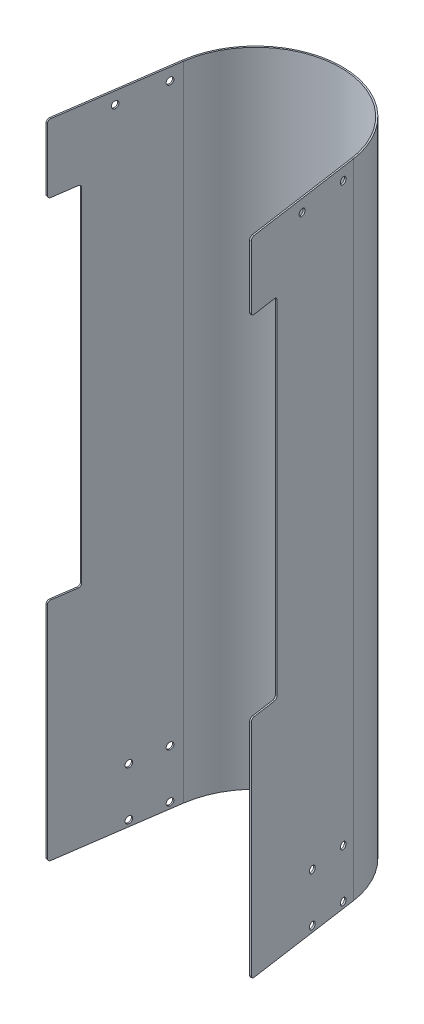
ISO-10303-21;
HEADER;
FILE_DESCRIPTION(('STEP AP214'),'2;1');
FILE_NAME('part.step','',(''),(''),'','','');
FILE_SCHEMA(('AUTOMOTIVE_DESIGN { 1 0 10303 214 1 1 1 1 }'));
ENDSEC;
DATA;
#1=APPLICATION_CONTEXT('core data for automotive mechanical design processes');
#2=APPLICATION_PROTOCOL_DEFINITION('international standard','automotive_design',2000,#1);
#3=PRODUCT_CONTEXT('',#1,'mechanical');
#4=PRODUCT('Part','Part','',(#3));
#5=PRODUCT_RELATED_PRODUCT_CATEGORY('part','',(#4));
#6=PRODUCT_DEFINITION_FORMATION('','',#4);
#7=PRODUCT_DEFINITION_CONTEXT('part definition',#1,'design');
#8=PRODUCT_DEFINITION('design','',#6,#7);
#9=PRODUCT_DEFINITION_SHAPE('','',#8);
#10=(LENGTH_UNIT() NAMED_UNIT(*) SI_UNIT(.MILLI.,.METRE.));
#11=(NAMED_UNIT(*) PLANE_ANGLE_UNIT() SI_UNIT($,.RADIAN.));
#12=(NAMED_UNIT(*) SI_UNIT($,.STERADIAN.) SOLID_ANGLE_UNIT());
#13=UNCERTAINTY_MEASURE_WITH_UNIT(LENGTH_MEASURE(1.E-05),#10,'distance_accuracy_value','');
#14=(GEOMETRIC_REPRESENTATION_CONTEXT(3) GLOBAL_UNCERTAINTY_ASSIGNED_CONTEXT((#13)) GLOBAL_UNIT_ASSIGNED_CONTEXT((#10,
#11,#12)) REPRESENTATION_CONTEXT('',''));
#15=CARTESIAN_POINT('',(0.,0.,0.));
#16=DIRECTION('',(0.,0.,1.));
#17=DIRECTION('',(1.,0.,0.));
#18=AXIS2_PLACEMENT_3D('',#15,#16,#17);
#19=CARTESIAN_POINT('',(105.90221532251,673.1,112.260807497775));
#20=DIRECTION('',(0.141906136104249,0.,0.989880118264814));
#21=DIRECTION('',(0.,-1.,0.));
#22=AXIS2_PLACEMENT_3D('',#19,#20,#21);
#23=PLANE('',#22);
#24=DIRECTION('',(0.,1.,0.));
#25=VECTOR('',#24,1.);
#26=CARTESIAN_POINT('',(107.473650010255,673.1,112.035531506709));
#27=LINE('',#26,#25);
#28=CARTESIAN_POINT('',(107.473650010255,669.925,112.035531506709));
#29=VERTEX_POINT('',#28);
#30=CARTESIAN_POINT('',(107.473650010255,604.645582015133,112.035531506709));
#31=VERTEX_POINT('',#30);
#32=EDGE_CURVE('E360',#29,#31,#27,.F.);
#33=ORIENTED_EDGE('',*,*,#32,.F.);
#34=DIRECTION('',(-0.989880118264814,0.,0.141906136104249));
#35=VECTOR('',#34,1.);
#36=CARTESIAN_POINT('',(105.90221532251,669.925,112.260807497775));
#37=LINE('',#36,#35);
#38=CARTESIAN_POINT('',(105.90221532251,669.925,112.260807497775));
#39=VERTEX_POINT('',#38);
#40=EDGE_CURVE('E415',#29,#39,#37,.T.);
#41=ORIENTED_EDGE('',*,*,#40,.T.);
#42=DIRECTION('',(0.,-1.,0.));
#43=VECTOR('',#42,1.);
#44=CARTESIAN_POINT('',(105.90221532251,673.1,112.260807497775));
#45=LINE('',#44,#43);
#46=CARTESIAN_POINT('',(105.90221532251,604.645582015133,112.260807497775));
#47=VERTEX_POINT('',#46);
#48=EDGE_CURVE('E293',#39,#47,#45,.T.);
#49=ORIENTED_EDGE('',*,*,#48,.T.);
#50=DIRECTION('',(0.989880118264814,0.,-0.141906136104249));
#51=VECTOR('',#50,1.);
#52=CARTESIAN_POINT('',(105.90221532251,604.645582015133,112.260807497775));
#53=LINE('',#52,#51);
#54=EDGE_CURVE('E411',#47,#31,#53,.T.);
#55=ORIENTED_EDGE('',*,*,#54,.T.);
#56=EDGE_LOOP('',(#33,#41,#49,#55));
#57=FACE_BOUND('',#56,.T.);
#58=ADVANCED_FACE('F47',(#57),#23,.T.);
#59=CARTESIAN_POINT('',(107.473650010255,233.30041798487,112.035531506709));
#60=VERTEX_POINT('',#59);
#61=CARTESIAN_POINT('',(107.473650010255,3.17500000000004,112.035531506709));
#62=VERTEX_POINT('',#61);
#63=EDGE_CURVE('E361',#60,#62,#27,.F.);
#64=ORIENTED_EDGE('',*,*,#63,.F.);
#65=DIRECTION('',(0.989880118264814,0.,-0.141906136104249));
#66=VECTOR('',#65,1.);
#67=CARTESIAN_POINT('',(105.90221532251,233.30041798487,112.260807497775));
#68=LINE('',#67,#66);
#69=CARTESIAN_POINT('',(105.90221532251,233.30041798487,112.260807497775));
#70=VERTEX_POINT('',#69);
#71=EDGE_CURVE('E464',#60,#70,#68,.F.);
#72=ORIENTED_EDGE('',*,*,#71,.T.);
#73=CARTESIAN_POINT('',(105.90221532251,3.17500000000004,112.260807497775));
#74=VERTEX_POINT('',#73);
#75=EDGE_CURVE('E540',#70,#74,#45,.T.);
#76=ORIENTED_EDGE('',*,*,#75,.T.);
#77=DIRECTION('',(0.989880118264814,0.,-0.141906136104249));
#78=VECTOR('',#77,1.);
#79=CARTESIAN_POINT('',(105.90221532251,3.17500000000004,112.260807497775));
#80=LINE('',#79,#78);
#81=EDGE_CURVE('E70',#74,#62,#80,.T.);
#82=ORIENTED_EDGE('',*,*,#81,.T.);
#83=EDGE_LOOP('',(#64,#72,#76,#82));
#84=FACE_BOUND('',#83,.T.);
#85=ADVANCED_FACE('F702',(#84),#23,.T.);
#86=CARTESIAN_POINT('',(88.000342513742,673.1,-12.6154554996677));
#87=DIRECTION('',(0.989880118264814,0.,-0.141906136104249));
#88=DIRECTION('',(-0.141906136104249,0.,-0.989880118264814));
#89=AXIS2_PLACEMENT_3D('',#86,#87,#88);
#90=PLANE('',#89);
#91=CARTESIAN_POINT('',(89.8025504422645,57.1500000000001,-0.0439779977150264));
#92=DIRECTION('',(0.989880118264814,0.,-0.141906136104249));
#93=DIRECTION('',(-0.141906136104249,0.,-0.989880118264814));
#94=AXIS2_PLACEMENT_3D('',#91,#92,#93);
#95=CIRCLE('',#94,3.57187499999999);
#96=CARTESIAN_POINT('',(89.2956794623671,57.1500000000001,-3.57970604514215));
#97=VERTEX_POINT('',#96);
#98=EDGE_CURVE('E1175',#97,#97,#95,.T.);
#99=ORIENTED_EDGE('',*,*,#98,.T.);
#100=EDGE_LOOP('',(#99));
#101=FACE_BOUND('',#100,.T.);
#102=CARTESIAN_POINT('',(95.2091742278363,57.1500000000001,37.6704545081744));
#103=DIRECTION('',(0.989880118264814,0.,-0.141906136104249));
#104=DIRECTION('',(-0.141906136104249,0.,-0.989880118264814));
#105=AXIS2_PLACEMENT_3D('',#102,#103,#104);
#106=CIRCLE('',#105,3.57187499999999);
#107=CARTESIAN_POINT('',(94.702303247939,57.1500000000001,34.1347264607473));
#108=VERTEX_POINT('',#107);
#109=EDGE_CURVE('E1179',#108,#108,#106,.T.);
#110=ORIENTED_EDGE('',*,*,#109,.T.);
#111=EDGE_LOOP('',(#110));
#112=FACE_BOUND('',#111,.T.);
#113=CARTESIAN_POINT('',(95.2091742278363,6.35000000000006,37.6704545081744));
#114=DIRECTION('',(0.989880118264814,0.,-0.141906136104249));
#115=DIRECTION('',(-0.141906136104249,0.,-0.989880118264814));
#116=AXIS2_PLACEMENT_3D('',#113,#114,#115);
#117=CIRCLE('',#116,3.57187499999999);
#118=CARTESIAN_POINT('',(94.702303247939,6.35000000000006,34.1347264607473));
#119=VERTEX_POINT('',#118);
#120=EDGE_CURVE('E1183',#119,#119,#117,.T.);
#121=ORIENTED_EDGE('',*,*,#120,.T.);
#122=EDGE_LOOP('',(#121));
#123=FACE_BOUND('',#122,.T.);
#124=CARTESIAN_POINT('',(89.8025504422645,6.35000000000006,-0.0439779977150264));
#125=DIRECTION('',(0.989880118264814,0.,-0.141906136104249));
#126=DIRECTION('',(-0.141906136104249,0.,-0.989880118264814));
#127=AXIS2_PLACEMENT_3D('',#124,#125,#126);
#128=CIRCLE('',#127,3.57187499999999);
#129=CARTESIAN_POINT('',(89.2956794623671,6.35000000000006,-3.57970604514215));
#130=VERTEX_POINT('',#129);
#131=EDGE_CURVE('E622',#130,#130,#128,.T.);
#132=ORIENTED_EDGE('',*,*,#131,.T.);
#133=EDGE_LOOP('',(#132));
#134=FACE_BOUND('',#133,.T.);
#135=CARTESIAN_POINT('',(97.0113821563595,660.4,50.2419320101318));
#136=DIRECTION('',(0.989880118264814,0.,-0.141906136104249));
#137=DIRECTION('',(-0.141906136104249,0.,-0.989880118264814));
#138=AXIS2_PLACEMENT_3D('',#135,#136,#137);
#139=CIRCLE('',#138,3.571875);
#140=CARTESIAN_POINT('',(96.5045111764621,660.4,46.7062039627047));
#141=VERTEX_POINT('',#140);
#142=EDGE_CURVE('E621',#141,#141,#139,.T.);
#143=ORIENTED_EDGE('',*,*,#142,.T.);
#144=EDGE_LOOP('',(#143));
#145=FACE_BOUND('',#144,.T.);
#146=CARTESIAN_POINT('',(89.8025504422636,660.4,-0.0439779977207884));
#147=DIRECTION('',(0.989880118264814,0.,-0.141906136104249));
#148=DIRECTION('',(-0.141906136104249,0.,-0.989880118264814));
#149=AXIS2_PLACEMENT_3D('',#146,#147,#148);
#150=CIRCLE('',#149,3.571875);
#151=CARTESIAN_POINT('',(89.2956794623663,660.4,-3.57970604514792));
#152=VERTEX_POINT('',#151);
#153=EDGE_CURVE('E630',#152,#152,#150,.T.);
#154=ORIENTED_EDGE('',*,*,#153,.T.);
#155=EDGE_LOOP('',(#154));
#156=FACE_BOUND('',#155,.T.);
#157=ORIENTED_EDGE('',*,*,#48,.F.);
#158=CARTESIAN_POINT('',(105.451663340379,669.925,109.117938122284));
#159=DIRECTION('',(0.989880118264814,0.,-0.141906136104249));
#160=DIRECTION('',(-0.141906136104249,0.,-0.989880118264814));
#161=AXIS2_PLACEMENT_3D('',#158,#159,#160);
#162=CIRCLE('',#161,3.175);
#163=CARTESIAN_POINT('',(105.451663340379,673.1,109.117938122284));
#164=VERTEX_POINT('',#163);
#165=EDGE_CURVE('E291',#39,#164,#162,.F.);
#166=ORIENTED_EDGE('',*,*,#165,.T.);
#167=DIRECTION('',(0.141906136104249,0.,0.989880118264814));
#168=VECTOR('',#167,1.);
#169=CARTESIAN_POINT('',(88.000342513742,673.1,-12.6154554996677));
#170=LINE('',#169,#168);
#171=CARTESIAN_POINT('',(88.000342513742,673.1,-12.6154554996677));
#172=VERTEX_POINT('',#171);
#173=EDGE_CURVE('E271',#172,#164,#170,.T.);
#174=ORIENTED_EDGE('',*,*,#173,.F.);
#175=DIRECTION('',(0.,-1.,0.));
#176=VECTOR('',#175,1.);
#177=CARTESIAN_POINT('',(88.000342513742,673.1,-12.6154554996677));
#178=LINE('',#177,#176);
#179=CARTESIAN_POINT('',(88.000342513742,0.,-12.6154554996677));
#180=VERTEX_POINT('',#179);
#181=EDGE_CURVE('E290',#172,#180,#178,.T.);
#182=ORIENTED_EDGE('',*,*,#181,.T.);
#183=DIRECTION('',(0.141906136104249,0.,0.989880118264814));
#184=VECTOR('',#183,1.);
#185=CARTESIAN_POINT('',(88.000342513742,0.,-12.6154554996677));
#186=LINE('',#185,#184);
#187=CARTESIAN_POINT('',(105.451663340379,0.,109.117938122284));
#188=VERTEX_POINT('',#187);
#189=EDGE_CURVE('E357',#180,#188,#186,.T.);
#190=ORIENTED_EDGE('',*,*,#189,.T.);
#191=CARTESIAN_POINT('',(105.451663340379,3.175,109.117938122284));
#192=DIRECTION('',(0.989880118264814,0.,-0.141906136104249));
#193=DIRECTION('',(-0.141906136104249,0.,-0.989880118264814));
#194=AXIS2_PLACEMENT_3D('',#191,#192,#193);
#195=CIRCLE('',#194,3.175);
#196=EDGE_CURVE('E418',#188,#74,#195,.F.);
#197=ORIENTED_EDGE('',*,*,#196,.T.);
#198=ORIENTED_EDGE('',*,*,#75,.F.);
#199=CARTESIAN_POINT('',(105.451663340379,233.30041798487,109.117938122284));
#200=DIRECTION('',(0.989880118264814,0.,-0.141906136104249));
#201=DIRECTION('',(-0.141906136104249,0.,-0.989880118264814));
#202=AXIS2_PLACEMENT_3D('',#199,#200,#201);
#203=CIRCLE('',#202,3.175);
#204=CARTESIAN_POINT('',(105.451663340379,236.47541798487,109.117938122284));
#205=VERTEX_POINT('',#204);
#206=EDGE_CURVE('E420',#70,#205,#203,.F.);
#207=ORIENTED_EDGE('',*,*,#206,.T.);
#208=DIRECTION('',(-0.141906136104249,0.,-0.989880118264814));
#209=VECTOR('',#208,1.);
#210=CARTESIAN_POINT('',(105.90221532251,236.47541798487,112.260807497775));
#211=LINE('',#210,#209);
#212=CARTESIAN_POINT('',(101.847247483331,236.47541798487,83.9749831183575));
#213=VERTEX_POINT('',#212);
#214=EDGE_CURVE('E564',#205,#213,#211,.T.);
#215=ORIENTED_EDGE('',*,*,#214,.T.);
#216=CARTESIAN_POINT('',(101.847247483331,239.65041798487,83.9749831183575));
#217=DIRECTION('',(0.989880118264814,0.,-0.141906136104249));
#218=DIRECTION('',(-0.141906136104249,0.,-0.989880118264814));
#219=AXIS2_PLACEMENT_3D('',#216,#217,#218);
#220=CIRCLE('',#219,3.175);
#221=CARTESIAN_POINT('',(101.3966955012,239.65041798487,80.8321137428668));
#222=VERTEX_POINT('',#221);
#223=EDGE_CURVE('E487',#213,#222,#220,.T.);
#224=ORIENTED_EDGE('',*,*,#223,.T.);
#225=DIRECTION('',(0.,1.,0.));
#226=VECTOR('',#225,1.);
#227=CARTESIAN_POINT('',(101.3966955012,601.470582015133,80.8321137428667));
#228=LINE('',#227,#226);
#229=CARTESIAN_POINT('',(101.3966955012,598.295582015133,80.8321137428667));
#230=VERTEX_POINT('',#229);
#231=EDGE_CURVE('E603',#222,#230,#228,.T.);
#232=ORIENTED_EDGE('',*,*,#231,.T.);
#233=CARTESIAN_POINT('',(101.847247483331,598.295582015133,83.9749831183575));
#234=DIRECTION('',(0.989880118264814,0.,-0.141906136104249));
#235=DIRECTION('',(-0.141906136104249,0.,-0.989880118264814));
#236=AXIS2_PLACEMENT_3D('',#233,#234,#235);
#237=CIRCLE('',#236,3.175);
#238=CARTESIAN_POINT('',(101.847247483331,601.470582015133,83.9749831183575));
#239=VERTEX_POINT('',#238);
#240=EDGE_CURVE('E493',#230,#239,#237,.T.);
#241=ORIENTED_EDGE('',*,*,#240,.T.);
#242=DIRECTION('',(0.141906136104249,0.,0.989880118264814));
#243=VECTOR('',#242,1.);
#244=CARTESIAN_POINT('',(105.90221532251,601.470582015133,112.260807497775));
#245=LINE('',#244,#243);
#246=CARTESIAN_POINT('',(105.451663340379,601.470582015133,109.117938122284));
#247=VERTEX_POINT('',#246);
#248=EDGE_CURVE('E670',#239,#247,#245,.T.);
#249=ORIENTED_EDGE('',*,*,#248,.T.);
#250=CARTESIAN_POINT('',(105.451663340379,604.645582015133,109.117938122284));
#251=DIRECTION('',(0.989880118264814,0.,-0.141906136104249));
#252=DIRECTION('',(-0.141906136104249,0.,-0.989880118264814));
#253=AXIS2_PLACEMENT_3D('',#250,#251,#252);
#254=CIRCLE('',#253,3.175);
#255=EDGE_CURVE('E422',#247,#47,#254,.F.);
#256=ORIENTED_EDGE('',*,*,#255,.T.);
#257=EDGE_LOOP('',(#157,#166,#174,#182,#190,#197,#198,#207,#215,#224,#232,#241,#249,#256));
#258=FACE_BOUND('',#257,.T.);
#259=ADVANCED_FACE('F287',(#101,#112,#123,#134,#145,#156,#258),#90,.F.);
#260=CARTESIAN_POINT('',(89.5717772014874,673.1,-12.8407314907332));
#261=DIRECTION('',(0.989880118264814,0.,-0.141906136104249));
#262=DIRECTION('',(-0.141906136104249,0.,-0.989880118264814));
#263=AXIS2_PLACEMENT_3D('',#260,#261,#262);
#264=PLANE('',#263);
#265=CARTESIAN_POINT('',(91.3739851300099,57.1500000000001,-0.269253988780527));
#266=DIRECTION('',(0.989880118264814,0.,-0.141906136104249));
#267=DIRECTION('',(-0.141906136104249,0.,-0.989880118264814));
#268=AXIS2_PLACEMENT_3D('',#265,#266,#267);
#269=CIRCLE('',#268,3.57187499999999);
#270=CARTESIAN_POINT('',(90.8671141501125,57.1500000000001,-3.80498203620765));
#271=VERTEX_POINT('',#270);
#272=EDGE_CURVE('E1211',#271,#271,#269,.T.);
#273=ORIENTED_EDGE('',*,*,#272,.F.);
#274=EDGE_LOOP('',(#273));
#275=FACE_BOUND('',#274,.T.);
#276=CARTESIAN_POINT('',(96.7806089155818,57.1500000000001,37.4451785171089));
#277=DIRECTION('',(0.989880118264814,0.,-0.141906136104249));
#278=DIRECTION('',(-0.141906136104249,0.,-0.989880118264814));
#279=AXIS2_PLACEMENT_3D('',#276,#277,#278);
#280=CIRCLE('',#279,3.57187499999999);
#281=CARTESIAN_POINT('',(96.2737379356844,57.1500000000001,33.9094504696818));
#282=VERTEX_POINT('',#281);
#283=EDGE_CURVE('E1206',#282,#282,#280,.T.);
#284=ORIENTED_EDGE('',*,*,#283,.F.);
#285=EDGE_LOOP('',(#284));
#286=FACE_BOUND('',#285,.T.);
#287=CARTESIAN_POINT('',(96.7806089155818,6.35000000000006,37.4451785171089));
#288=DIRECTION('',(0.989880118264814,0.,-0.141906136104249));
#289=DIRECTION('',(-0.141906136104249,0.,-0.989880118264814));
#290=AXIS2_PLACEMENT_3D('',#287,#288,#289);
#291=CIRCLE('',#290,3.57187499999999);
#292=CARTESIAN_POINT('',(96.2737379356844,6.35000000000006,33.9094504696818));
#293=VERTEX_POINT('',#292);
#294=EDGE_CURVE('E1200',#293,#293,#291,.T.);
#295=ORIENTED_EDGE('',*,*,#294,.F.);
#296=EDGE_LOOP('',(#295));
#297=FACE_BOUND('',#296,.T.);
#298=CARTESIAN_POINT('',(91.3739851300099,6.35000000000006,-0.269253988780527));
#299=DIRECTION('',(0.989880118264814,0.,-0.141906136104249));
#300=DIRECTION('',(-0.141906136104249,0.,-0.989880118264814));
#301=AXIS2_PLACEMENT_3D('',#298,#299,#300);
#302=CIRCLE('',#301,3.57187499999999);
#303=CARTESIAN_POINT('',(90.8671141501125,6.35000000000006,-3.80498203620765));
#304=VERTEX_POINT('',#303);
#305=EDGE_CURVE('E1192',#304,#304,#302,.T.);
#306=ORIENTED_EDGE('',*,*,#305,.F.);
#307=EDGE_LOOP('',(#306));
#308=FACE_BOUND('',#307,.T.);
#309=CARTESIAN_POINT('',(98.5828168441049,660.4,50.0166560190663));
#310=DIRECTION('',(0.989880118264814,0.,-0.141906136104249));
#311=DIRECTION('',(-0.141906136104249,0.,-0.989880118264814));
#312=AXIS2_PLACEMENT_3D('',#309,#310,#311);
#313=CIRCLE('',#312,3.571875);
#314=CARTESIAN_POINT('',(98.0759458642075,660.4,46.4809279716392));
#315=VERTEX_POINT('',#314);
#316=EDGE_CURVE('E618',#315,#315,#313,.T.);
#317=ORIENTED_EDGE('',*,*,#316,.F.);
#318=EDGE_LOOP('',(#317));
#319=FACE_BOUND('',#318,.T.);
#320=CARTESIAN_POINT('',(91.373985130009,660.4,-0.269253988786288));
#321=DIRECTION('',(0.989880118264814,0.,-0.141906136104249));
#322=DIRECTION('',(-0.141906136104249,0.,-0.989880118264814));
#323=AXIS2_PLACEMENT_3D('',#320,#321,#322);
#324=CIRCLE('',#323,3.571875);
#325=CARTESIAN_POINT('',(90.8671141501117,660.4,-3.80498203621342));
#326=VERTEX_POINT('',#325);
#327=EDGE_CURVE('E625',#326,#326,#324,.T.);
#328=ORIENTED_EDGE('',*,*,#327,.F.);
#329=EDGE_LOOP('',(#328));
#330=FACE_BOUND('',#329,.T.);
#331=DIRECTION('',(-0.141906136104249,0.,-0.989880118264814));
#332=VECTOR('',#331,1.);
#333=CARTESIAN_POINT('',(89.5717772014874,673.1,-12.8407314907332));
#334=LINE('',#333,#332);
#335=CARTESIAN_POINT('',(89.5717772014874,673.1,-12.8407314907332));
#336=VERTEX_POINT('',#335);
#337=CARTESIAN_POINT('',(107.023098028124,673.1,108.892662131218));
#338=VERTEX_POINT('',#337);
#339=EDGE_CURVE('E274',#336,#338,#334,.F.);
#340=ORIENTED_EDGE('',*,*,#339,.T.);
#341=CARTESIAN_POINT('',(107.023098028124,669.925,108.892662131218));
#342=DIRECTION('',(0.989880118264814,0.,-0.141906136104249));
#343=DIRECTION('',(-0.141906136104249,0.,-0.989880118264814));
#344=AXIS2_PLACEMENT_3D('',#341,#342,#343);
#345=CIRCLE('',#344,3.175);
#346=EDGE_CURVE('E436',#338,#29,#345,.T.);
#347=ORIENTED_EDGE('',*,*,#346,.T.);
#348=ORIENTED_EDGE('',*,*,#32,.T.);
#349=CARTESIAN_POINT('',(107.023098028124,604.645582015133,108.892662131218));
#350=DIRECTION('',(0.989880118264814,0.,-0.141906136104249));
#351=DIRECTION('',(-0.141906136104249,0.,-0.989880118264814));
#352=AXIS2_PLACEMENT_3D('',#349,#350,#351);
#353=CIRCLE('',#352,3.175);
#354=CARTESIAN_POINT('',(107.023098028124,601.470582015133,108.892662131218));
#355=VERTEX_POINT('',#354);
#356=EDGE_CURVE('E433',#31,#355,#353,.T.);
#357=ORIENTED_EDGE('',*,*,#356,.T.);
#358=DIRECTION('',(-0.141906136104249,0.,-0.989880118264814));
#359=VECTOR('',#358,1.);
#360=CARTESIAN_POINT('',(107.473650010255,601.470582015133,112.035531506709));
#361=LINE('',#360,#359);
#362=CARTESIAN_POINT('',(103.418682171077,601.470582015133,83.749707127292));
#363=VERTEX_POINT('',#362);
#364=EDGE_CURVE('E557',#355,#363,#361,.T.);
#365=ORIENTED_EDGE('',*,*,#364,.T.);
#366=CARTESIAN_POINT('',(103.418682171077,598.295582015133,83.749707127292));
#367=DIRECTION('',(0.989880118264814,0.,-0.141906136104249));
#368=DIRECTION('',(-0.141906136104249,0.,-0.989880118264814));
#369=AXIS2_PLACEMENT_3D('',#366,#367,#368);
#370=CIRCLE('',#369,3.175);
#371=CARTESIAN_POINT('',(102.968130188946,598.295582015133,80.6068377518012));
#372=VERTEX_POINT('',#371);
#373=EDGE_CURVE('E490',#363,#372,#370,.F.);
#374=ORIENTED_EDGE('',*,*,#373,.T.);
#375=DIRECTION('',(0.,-1.,0.));
#376=VECTOR('',#375,1.);
#377=CARTESIAN_POINT('',(102.968130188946,601.470582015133,80.6068377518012));
#378=LINE('',#377,#376);
#379=CARTESIAN_POINT('',(102.968130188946,239.65041798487,80.6068377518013));
#380=VERTEX_POINT('',#379);
#381=EDGE_CURVE('E565',#372,#380,#378,.T.);
#382=ORIENTED_EDGE('',*,*,#381,.T.);
#383=CARTESIAN_POINT('',(103.418682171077,239.65041798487,83.749707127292));
#384=DIRECTION('',(0.989880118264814,0.,-0.141906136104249));
#385=DIRECTION('',(-0.141906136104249,0.,-0.989880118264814));
#386=AXIS2_PLACEMENT_3D('',#383,#384,#385);
#387=CIRCLE('',#386,3.175);
#388=CARTESIAN_POINT('',(103.418682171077,236.47541798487,83.749707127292));
#389=VERTEX_POINT('',#388);
#390=EDGE_CURVE('E484',#380,#389,#387,.F.);
#391=ORIENTED_EDGE('',*,*,#390,.T.);
#392=DIRECTION('',(0.141906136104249,0.,0.989880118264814));
#393=VECTOR('',#392,1.);
#394=CARTESIAN_POINT('',(107.473650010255,236.47541798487,112.035531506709));
#395=LINE('',#394,#393);
#396=CARTESIAN_POINT('',(107.023098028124,236.47541798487,108.892662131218));
#397=VERTEX_POINT('',#396);
#398=EDGE_CURVE('E573',#389,#397,#395,.T.);
#399=ORIENTED_EDGE('',*,*,#398,.T.);
#400=CARTESIAN_POINT('',(107.023098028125,233.30041798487,108.892662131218));
#401=DIRECTION('',(0.989880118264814,0.,-0.141906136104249));
#402=DIRECTION('',(-0.141906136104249,0.,-0.989880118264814));
#403=AXIS2_PLACEMENT_3D('',#400,#401,#402);
#404=CIRCLE('',#403,3.175);
#405=EDGE_CURVE('E431',#397,#60,#404,.T.);
#406=ORIENTED_EDGE('',*,*,#405,.T.);
#407=ORIENTED_EDGE('',*,*,#63,.T.);
#408=CARTESIAN_POINT('',(107.023098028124,3.175,108.892662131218));
#409=DIRECTION('',(0.989880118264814,0.,-0.141906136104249));
#410=DIRECTION('',(-0.141906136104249,0.,-0.989880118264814));
#411=AXIS2_PLACEMENT_3D('',#408,#409,#410);
#412=CIRCLE('',#411,3.175);
#413=CARTESIAN_POINT('',(107.023098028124,0.,108.892662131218));
#414=VERTEX_POINT('',#413);
#415=EDGE_CURVE('E62',#62,#414,#412,.T.);
#416=ORIENTED_EDGE('',*,*,#415,.T.);
#417=DIRECTION('',(-0.141906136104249,0.,-0.989880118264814));
#418=VECTOR('',#417,1.);
#419=CARTESIAN_POINT('',(89.5717772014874,0.,-12.8407314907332));
#420=LINE('',#419,#418);
#421=CARTESIAN_POINT('',(89.5717772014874,0.,-12.8407314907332));
#422=VERTEX_POINT('',#421);
#423=EDGE_CURVE('E363',#422,#414,#420,.F.);
#424=ORIENTED_EDGE('',*,*,#423,.F.);
#425=DIRECTION('',(0.,1.,0.));
#426=VECTOR('',#425,1.);
#427=CARTESIAN_POINT('',(89.5717772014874,673.1,-12.8407314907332));
#428=LINE('',#427,#426);
#429=EDGE_CURVE('E333',#336,#422,#428,.F.);
#430=ORIENTED_EDGE('',*,*,#429,.F.);
#431=EDGE_LOOP('',(#340,#347,#348,#357,#365,#374,#382,#391,#399,#406,#407,#416,#424,#430));
#432=FACE_BOUND('',#431,.T.);
#433=ADVANCED_FACE('F556',(#275,#286,#297,#308,#319,#330,#432),#264,.T.);
#434=CARTESIAN_POINT('',(-105.90221532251,673.1,112.260807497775));
#435=DIRECTION('',(0.141906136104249,0.,-0.989880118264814));
#436=DIRECTION('',(0.,-1.,0.));
#437=AXIS2_PLACEMENT_3D('',#434,#435,#436);
#438=PLANE('',#437);
#439=DIRECTION('',(0.,-1.,0.));
#440=VECTOR('',#439,1.);
#441=CARTESIAN_POINT('',(-105.90221532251,673.1,112.260807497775));
#442=LINE('',#441,#440);
#443=CARTESIAN_POINT('',(-105.90221532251,233.30041798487,112.260807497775));
#444=VERTEX_POINT('',#443);
#445=CARTESIAN_POINT('',(-105.90221532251,3.17500000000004,112.260807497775));
#446=VERTEX_POINT('',#445);
#447=EDGE_CURVE('E326',#444,#446,#442,.T.);
#448=ORIENTED_EDGE('',*,*,#447,.F.);
#449=DIRECTION('',(-0.989880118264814,0.,-0.141906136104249));
#450=VECTOR('',#449,1.);
#451=CARTESIAN_POINT('',(-107.473650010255,233.30041798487,112.035531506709));
#452=LINE('',#451,#450);
#453=CARTESIAN_POINT('',(-107.473650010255,233.30041798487,112.035531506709));
#454=VERTEX_POINT('',#453);
#455=EDGE_CURVE('E449',#444,#454,#452,.T.);
#456=ORIENTED_EDGE('',*,*,#455,.T.);
#457=DIRECTION('',(0.,1.,0.));
#458=VECTOR('',#457,1.);
#459=CARTESIAN_POINT('',(-107.473650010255,673.1,112.035531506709));
#460=LINE('',#459,#458);
#461=CARTESIAN_POINT('',(-107.473650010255,3.17500000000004,112.035531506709));
#462=VERTEX_POINT('',#461);
#463=EDGE_CURVE('E350',#454,#462,#460,.F.);
#464=ORIENTED_EDGE('',*,*,#463,.T.);
#465=DIRECTION('',(-0.989880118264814,0.,-0.141906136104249));
#466=VECTOR('',#465,1.);
#467=CARTESIAN_POINT('',(-105.90221532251,3.17500000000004,112.260807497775));
#468=LINE('',#467,#466);
#469=EDGE_CURVE('E446',#462,#446,#468,.F.);
#470=ORIENTED_EDGE('',*,*,#469,.T.);
#471=EDGE_LOOP('',(#448,#456,#464,#470));
#472=FACE_BOUND('',#471,.T.);
#473=ADVANCED_FACE('F768',(#472),#438,.F.);
#474=CARTESIAN_POINT('',(88.000342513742,673.1,-12.6154554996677));
#475=DIRECTION('',(0.,1.,0.));
#476=DIRECTION('',(0.141906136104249,0.,0.989880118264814));
#477=AXIS2_PLACEMENT_3D('',#474,#475,#476);
#478=PLANE('',#477);
#479=ORIENTED_EDGE('',*,*,#173,.T.);
#480=DIRECTION('',(-0.989880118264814,0.,0.141906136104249));
#481=VECTOR('',#480,1.);
#482=CARTESIAN_POINT('',(105.451663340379,673.1,109.117938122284));
#483=LINE('',#482,#481);
#484=EDGE_CURVE('E427',#164,#338,#483,.F.);
#485=ORIENTED_EDGE('',*,*,#484,.T.);
#486=ORIENTED_EDGE('',*,*,#339,.F.);
#487=DIRECTION('',(-0.989880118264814,0.,0.141906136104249));
#488=VECTOR('',#487,1.);
#489=CARTESIAN_POINT('',(88.000342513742,673.1,-12.6154554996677));
#490=LINE('',#489,#488);
#491=EDGE_CURVE('E268',#336,#172,#490,.T.);
#492=ORIENTED_EDGE('',*,*,#491,.T.);
#493=EDGE_LOOP('',(#479,#485,#486,#492));
#494=FACE_BOUND('',#493,.T.);
#495=ADVANCED_FACE('F270',(#494),#478,.T.);
#496=CARTESIAN_POINT('',(0.,673.1,0.));
#497=DIRECTION('',(0.,1.,0.));
#498=DIRECTION('',(0.,0.,1.));
#499=AXIS2_PLACEMENT_3D('',#496,#497,#498);
#500=PLANE('',#499);
#501=ORIENTED_EDGE('',*,*,#491,.F.);
#502=CARTESIAN_POINT('',(0.,673.1,0.));
#503=DIRECTION('',(0.,-1.,0.));
#504=DIRECTION('',(0.,0.,-1.));
#505=AXIS2_PLACEMENT_3D('',#502,#503,#504);
#506=CIRCLE('',#505,90.4875);
#507=CARTESIAN_POINT('',(-89.5717772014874,673.1,-12.8407314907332));
#508=VERTEX_POINT('',#507);
#509=EDGE_CURVE('E346',#508,#336,#506,.T.);
#510=ORIENTED_EDGE('',*,*,#509,.F.);
#511=DIRECTION('',(0.989880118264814,0.,0.141906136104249));
#512=VECTOR('',#511,1.);
#513=CARTESIAN_POINT('',(-88.000342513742,673.1,-12.6154554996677));
#514=LINE('',#513,#512);
#515=CARTESIAN_POINT('',(-88.000342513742,673.1,-12.6154554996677));
#516=VERTEX_POINT('',#515);
#517=EDGE_CURVE('E282',#508,#516,#514,.T.);
#518=ORIENTED_EDGE('',*,*,#517,.T.);
#519=CARTESIAN_POINT('',(0.,673.1,0.));
#520=DIRECTION('',(0.,-1.,0.));
#521=DIRECTION('',(0.,0.,1.));
#522=AXIS2_PLACEMENT_3D('',#519,#520,#521);
#523=CIRCLE('',#522,88.9);
#524=EDGE_CURVE('E297',#516,#172,#523,.T.);
#525=ORIENTED_EDGE('',*,*,#524,.T.);
#526=EDGE_LOOP('',(#501,#510,#518,#525));
#527=FACE_BOUND('',#526,.T.);
#528=ADVANCED_FACE('F298',(#527),#500,.T.);
#529=CARTESIAN_POINT('',(-88.000342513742,673.1,-12.6154554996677));
#530=DIRECTION('',(0.,1.,0.));
#531=DIRECTION('',(0.141906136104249,0.,-0.989880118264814));
#532=AXIS2_PLACEMENT_3D('',#529,#530,#531);
#533=PLANE('',#532);
#534=DIRECTION('',(-0.141906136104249,0.,0.989880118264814));
#535=VECTOR('',#534,1.);
#536=CARTESIAN_POINT('',(-89.5717772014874,673.1,-12.8407314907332));
#537=LINE('',#536,#535);
#538=CARTESIAN_POINT('',(-107.023098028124,673.1,108.892662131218));
#539=VERTEX_POINT('',#538);
#540=EDGE_CURVE('E341',#539,#508,#537,.F.);
#541=ORIENTED_EDGE('',*,*,#540,.F.);
#542=DIRECTION('',(-0.989880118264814,0.,-0.141906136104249));
#543=VECTOR('',#542,1.);
#544=CARTESIAN_POINT('',(-105.451663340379,673.1,109.117938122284));
#545=LINE('',#544,#543);
#546=CARTESIAN_POINT('',(-105.451663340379,673.1,109.117938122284));
#547=VERTEX_POINT('',#546);
#548=EDGE_CURVE('E281',#539,#547,#545,.F.);
#549=ORIENTED_EDGE('',*,*,#548,.T.);
#550=DIRECTION('',(0.141906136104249,0.,-0.989880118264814));
#551=VECTOR('',#550,1.);
#552=CARTESIAN_POINT('',(-88.000342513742,673.1,-12.6154554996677));
#553=LINE('',#552,#551);
#554=EDGE_CURVE('E323',#547,#516,#553,.T.);
#555=ORIENTED_EDGE('',*,*,#554,.T.);
#556=ORIENTED_EDGE('',*,*,#517,.F.);
#557=EDGE_LOOP('',(#541,#549,#555,#556));
#558=FACE_BOUND('',#557,.T.);
#559=ADVANCED_FACE('F758',(#558),#533,.T.);
#560=CARTESIAN_POINT('',(-105.90221532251,669.925,112.260807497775));
#561=VERTEX_POINT('',#560);
#562=CARTESIAN_POINT('',(-105.90221532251,604.645582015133,112.260807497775));
#563=VERTEX_POINT('',#562);
#564=EDGE_CURVE('E327',#561,#563,#442,.T.);
#565=ORIENTED_EDGE('',*,*,#564,.F.);
#566=DIRECTION('',(0.989880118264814,0.,0.141906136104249));
#567=VECTOR('',#566,1.);
#568=CARTESIAN_POINT('',(-105.90221532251,669.925,112.260807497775));
#569=LINE('',#568,#567);
#570=CARTESIAN_POINT('',(-107.473650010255,669.925,112.035531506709));
#571=VERTEX_POINT('',#570);
#572=EDGE_CURVE('E391',#561,#571,#569,.F.);
#573=ORIENTED_EDGE('',*,*,#572,.T.);
#574=CARTESIAN_POINT('',(-107.473650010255,604.645582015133,112.035531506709));
#575=VERTEX_POINT('',#574);
#576=EDGE_CURVE('E347',#571,#575,#460,.F.);
#577=ORIENTED_EDGE('',*,*,#576,.T.);
#578=DIRECTION('',(-0.989880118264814,0.,-0.141906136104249));
#579=VECTOR('',#578,1.);
#580=CARTESIAN_POINT('',(-105.90221532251,604.645582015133,112.260807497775));
#581=LINE('',#580,#579);
#582=EDGE_CURVE('E388',#575,#563,#581,.F.);
#583=ORIENTED_EDGE('',*,*,#582,.T.);
#584=EDGE_LOOP('',(#565,#573,#577,#583));
#585=FACE_BOUND('',#584,.T.);
#586=ADVANCED_FACE('F596',(#585),#438,.F.);
#587=CARTESIAN_POINT('',(-88.000342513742,0.,-12.6154554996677));
#588=DIRECTION('',(0.,1.,0.));
#589=DIRECTION('',(0.141906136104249,0.,-0.989880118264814));
#590=AXIS2_PLACEMENT_3D('',#587,#588,#589);
#591=PLANE('',#590);
#592=DIRECTION('',(0.141906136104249,0.,-0.989880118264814));
#593=VECTOR('',#592,1.);
#594=CARTESIAN_POINT('',(-88.000342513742,0.,-12.6154554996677));
#595=LINE('',#594,#593);
#596=CARTESIAN_POINT('',(-105.451663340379,0.,109.117938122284));
#597=VERTEX_POINT('',#596);
#598=CARTESIAN_POINT('',(-88.000342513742,0.,-12.6154554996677));
#599=VERTEX_POINT('',#598);
#600=EDGE_CURVE('E312',#597,#599,#595,.T.);
#601=ORIENTED_EDGE('',*,*,#600,.F.);
#602=DIRECTION('',(-0.989880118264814,0.,-0.141906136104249));
#603=VECTOR('',#602,1.);
#604=CARTESIAN_POINT('',(-105.451663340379,0.,109.117938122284));
#605=LINE('',#604,#603);
#606=CARTESIAN_POINT('',(-107.023098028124,0.,108.892662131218));
#607=VERTEX_POINT('',#606);
#608=EDGE_CURVE('E466',#597,#607,#605,.T.);
#609=ORIENTED_EDGE('',*,*,#608,.T.);
#610=DIRECTION('',(-0.141906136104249,0.,0.989880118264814));
#611=VECTOR('',#610,1.);
#612=CARTESIAN_POINT('',(-89.5717772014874,0.,-12.8407314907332));
#613=LINE('',#612,#611);
#614=CARTESIAN_POINT('',(-89.5717772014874,0.,-12.8407314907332));
#615=VERTEX_POINT('',#614);
#616=EDGE_CURVE('E336',#607,#615,#613,.F.);
#617=ORIENTED_EDGE('',*,*,#616,.T.);
#618=DIRECTION('',(0.989880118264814,0.,0.141906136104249));
#619=VECTOR('',#618,1.);
#620=CARTESIAN_POINT('',(-88.000342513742,0.,-12.6154554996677));
#621=LINE('',#620,#619);
#622=EDGE_CURVE('E367',#615,#599,#621,.T.);
#623=ORIENTED_EDGE('',*,*,#622,.T.);
#624=EDGE_LOOP('',(#601,#609,#617,#623));
#625=FACE_BOUND('',#624,.T.);
#626=ADVANCED_FACE('F763',(#625),#591,.F.);
#627=CARTESIAN_POINT('',(0.,0.,0.));
#628=DIRECTION('',(0.,1.,0.));
#629=DIRECTION('',(0.,0.,1.));
#630=AXIS2_PLACEMENT_3D('',#627,#628,#629);
#631=PLANE('',#630);
#632=ORIENTED_EDGE('',*,*,#622,.F.);
#633=CARTESIAN_POINT('',(0.,0.,0.));
#634=DIRECTION('',(0.,-1.,0.));
#635=DIRECTION('',(0.,0.,-1.));
#636=AXIS2_PLACEMENT_3D('',#633,#634,#635);
#637=CIRCLE('',#636,90.4875);
#638=EDGE_CURVE('E342',#615,#422,#637,.T.);
#639=ORIENTED_EDGE('',*,*,#638,.T.);
#640=DIRECTION('',(-0.989880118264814,0.,0.141906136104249));
#641=VECTOR('',#640,1.);
#642=CARTESIAN_POINT('',(88.000342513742,0.,-12.6154554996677));
#643=LINE('',#642,#641);
#644=EDGE_CURVE('E304',#422,#180,#643,.T.);
#645=ORIENTED_EDGE('',*,*,#644,.T.);
#646=CARTESIAN_POINT('',(0.,0.,0.));
#647=DIRECTION('',(0.,-1.,0.));
#648=DIRECTION('',(0.,0.,1.));
#649=AXIS2_PLACEMENT_3D('',#646,#647,#648);
#650=CIRCLE('',#649,88.9);
#651=EDGE_CURVE('E305',#599,#180,#650,.T.);
#652=ORIENTED_EDGE('',*,*,#651,.F.);
#653=EDGE_LOOP('',(#632,#639,#645,#652));
#654=FACE_BOUND('',#653,.T.);
#655=ADVANCED_FACE('F713',(#654),#631,.F.);
#656=CARTESIAN_POINT('',(88.000342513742,0.,-12.6154554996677));
#657=DIRECTION('',(0.,1.,0.));
#658=DIRECTION('',(0.141906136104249,0.,0.989880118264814));
#659=AXIS2_PLACEMENT_3D('',#656,#657,#658);
#660=PLANE('',#659);
#661=ORIENTED_EDGE('',*,*,#423,.T.);
#662=DIRECTION('',(-0.989880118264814,0.,0.141906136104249));
#663=VECTOR('',#662,1.);
#664=CARTESIAN_POINT('',(105.451663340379,0.,109.117938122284));
#665=LINE('',#664,#663);
#666=EDGE_CURVE('E468',#414,#188,#665,.T.);
#667=ORIENTED_EDGE('',*,*,#666,.T.);
#668=ORIENTED_EDGE('',*,*,#189,.F.);
#669=ORIENTED_EDGE('',*,*,#644,.F.);
#670=EDGE_LOOP('',(#661,#667,#668,#669));
#671=FACE_BOUND('',#670,.T.);
#672=ADVANCED_FACE('F710',(#671),#660,.F.);
#673=CARTESIAN_POINT('',(0.,673.1,0.));
#674=DIRECTION('',(0.,-1.,0.));
#675=DIRECTION('',(0.,0.,-1.));
#676=AXIS2_PLACEMENT_3D('',#673,#674,#675);
#677=CYLINDRICAL_SURFACE('',#676,88.9);
#678=ORIENTED_EDGE('',*,*,#651,.T.);
#679=ORIENTED_EDGE('',*,*,#181,.F.);
#680=ORIENTED_EDGE('',*,*,#524,.F.);
#681=DIRECTION('',(0.,-1.,0.));
#682=VECTOR('',#681,1.);
#683=CARTESIAN_POINT('',(-88.000342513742,673.1,-12.6154554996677));
#684=LINE('',#683,#682);
#685=EDGE_CURVE('E317',#516,#599,#684,.T.);
#686=ORIENTED_EDGE('',*,*,#685,.T.);
#687=EDGE_LOOP('',(#678,#679,#680,#686));
#688=FACE_BOUND('',#687,.T.);
#689=ADVANCED_FACE('F308',(#688),#677,.F.);
#690=CARTESIAN_POINT('',(-88.000342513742,673.1,-12.6154554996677));
#691=DIRECTION('',(-0.989880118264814,0.,-0.141906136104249));
#692=DIRECTION('',(-0.141906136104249,0.,0.989880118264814));
#693=AXIS2_PLACEMENT_3D('',#690,#691,#692);
#694=PLANE('',#693);
#695=CARTESIAN_POINT('',(-89.8025504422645,57.1500000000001,-0.0439779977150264));
#696=DIRECTION('',(-0.989880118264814,0.,-0.141906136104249));
#697=DIRECTION('',(-0.141906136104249,0.,0.989880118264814));
#698=AXIS2_PLACEMENT_3D('',#695,#696,#697);
#699=CIRCLE('',#698,3.57187499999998);
#700=CARTESIAN_POINT('',(-90.3094214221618,57.1500000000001,3.49175004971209));
#701=VERTEX_POINT('',#700);
#702=EDGE_CURVE('E641',#701,#701,#699,.T.);
#703=ORIENTED_EDGE('',*,*,#702,.T.);
#704=EDGE_LOOP('',(#703));
#705=FACE_BOUND('',#704,.T.);
#706=CARTESIAN_POINT('',(-95.2091742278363,57.1500000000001,37.6704545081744));
#707=DIRECTION('',(-0.989880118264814,0.,-0.141906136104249));
#708=DIRECTION('',(-0.141906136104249,0.,0.989880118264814));
#709=AXIS2_PLACEMENT_3D('',#706,#707,#708);
#710=CIRCLE('',#709,3.57187499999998);
#711=CARTESIAN_POINT('',(-95.7160452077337,57.1500000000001,41.2061825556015));
#712=VERTEX_POINT('',#711);
#713=EDGE_CURVE('E649',#712,#712,#710,.T.);
#714=ORIENTED_EDGE('',*,*,#713,.T.);
#715=EDGE_LOOP('',(#714));
#716=FACE_BOUND('',#715,.T.);
#717=CARTESIAN_POINT('',(-95.2091742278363,6.35000000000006,37.6704545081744));
#718=DIRECTION('',(-0.989880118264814,0.,-0.141906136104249));
#719=DIRECTION('',(-0.141906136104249,0.,0.989880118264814));
#720=AXIS2_PLACEMENT_3D('',#717,#718,#719);
#721=CIRCLE('',#720,3.57187499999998);
#722=CARTESIAN_POINT('',(-95.7160452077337,6.35000000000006,41.2061825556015));
#723=VERTEX_POINT('',#722);
#724=EDGE_CURVE('E656',#723,#723,#721,.T.);
#725=ORIENTED_EDGE('',*,*,#724,.T.);
#726=EDGE_LOOP('',(#725));
#727=FACE_BOUND('',#726,.T.);
#728=CARTESIAN_POINT('',(-89.8025504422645,6.35000000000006,-0.0439779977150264));
#729=DIRECTION('',(-0.989880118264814,0.,-0.141906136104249));
#730=DIRECTION('',(-0.141906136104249,0.,0.989880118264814));
#731=AXIS2_PLACEMENT_3D('',#728,#729,#730);
#732=CIRCLE('',#731,3.57187499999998);
#733=CARTESIAN_POINT('',(-90.3094214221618,6.35000000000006,3.49175004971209));
#734=VERTEX_POINT('',#733);
#735=EDGE_CURVE('E615',#734,#734,#732,.T.);
#736=ORIENTED_EDGE('',*,*,#735,.T.);
#737=EDGE_LOOP('',(#736));
#738=FACE_BOUND('',#737,.T.);
#739=CARTESIAN_POINT('',(-97.0113821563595,660.4,50.2419320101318));
#740=DIRECTION('',(-0.989880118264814,0.,-0.141906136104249));
#741=DIRECTION('',(-0.141906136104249,0.,0.989880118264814));
#742=AXIS2_PLACEMENT_3D('',#739,#740,#741);
#743=CIRCLE('',#742,3.571875);
#744=CARTESIAN_POINT('',(-97.5182531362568,660.4,53.7776600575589));
#745=VERTEX_POINT('',#744);
#746=EDGE_CURVE('E608',#745,#745,#743,.T.);
#747=ORIENTED_EDGE('',*,*,#746,.T.);
#748=EDGE_LOOP('',(#747));
#749=FACE_BOUND('',#748,.T.);
#750=CARTESIAN_POINT('',(-89.8025504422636,660.4,-0.0439779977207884));
#751=DIRECTION('',(-0.989880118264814,0.,-0.141906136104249));
#752=DIRECTION('',(-0.141906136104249,0.,0.989880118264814));
#753=AXIS2_PLACEMENT_3D('',#750,#751,#752);
#754=CIRCLE('',#753,3.571875);
#755=CARTESIAN_POINT('',(-90.309421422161,660.4,3.49175004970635));
#756=VERTEX_POINT('',#755);
#757=EDGE_CURVE('E600',#756,#756,#754,.T.);
#758=ORIENTED_EDGE('',*,*,#757,.T.);
#759=EDGE_LOOP('',(#758));
#760=FACE_BOUND('',#759,.T.);
#761=ORIENTED_EDGE('',*,*,#554,.F.);
#762=CARTESIAN_POINT('',(-105.451663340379,669.925,109.117938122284));
#763=DIRECTION('',(-0.989880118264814,0.,-0.141906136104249));
#764=DIRECTION('',(-0.141906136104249,0.,0.989880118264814));
#765=AXIS2_PLACEMENT_3D('',#762,#763,#764);
#766=CIRCLE('',#765,3.175);
#767=EDGE_CURVE('E385',#547,#561,#766,.F.);
#768=ORIENTED_EDGE('',*,*,#767,.T.);
#769=ORIENTED_EDGE('',*,*,#564,.T.);
#770=CARTESIAN_POINT('',(-105.451663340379,604.645582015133,109.117938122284));
#771=DIRECTION('',(-0.989880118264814,0.,-0.141906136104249));
#772=DIRECTION('',(-0.141906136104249,0.,0.989880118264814));
#773=AXIS2_PLACEMENT_3D('',#770,#771,#772);
#774=CIRCLE('',#773,3.175);
#775=CARTESIAN_POINT('',(-105.451663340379,601.470582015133,109.117938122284));
#776=VERTEX_POINT('',#775);
#777=EDGE_CURVE('E382',#563,#776,#774,.F.);
#778=ORIENTED_EDGE('',*,*,#777,.T.);
#779=DIRECTION('',(-0.141906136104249,0.,0.989880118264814));
#780=VECTOR('',#779,1.);
#781=CARTESIAN_POINT('',(-105.90221532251,601.470582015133,112.260807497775));
#782=LINE('',#781,#780);
#783=CARTESIAN_POINT('',(-101.847247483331,601.470582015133,83.9749831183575));
#784=VERTEX_POINT('',#783);
#785=EDGE_CURVE('E366',#784,#776,#782,.T.);
#786=ORIENTED_EDGE('',*,*,#785,.F.);
#787=CARTESIAN_POINT('',(-101.847247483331,598.295582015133,83.9749831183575));
#788=DIRECTION('',(-0.989880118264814,0.,-0.141906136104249));
#789=DIRECTION('',(-0.141906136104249,0.,0.989880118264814));
#790=AXIS2_PLACEMENT_3D('',#787,#788,#789);
#791=CIRCLE('',#790,3.175);
#792=CARTESIAN_POINT('',(-101.3966955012,598.295582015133,80.8321137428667));
#793=VERTEX_POINT('',#792);
#794=EDGE_CURVE('E499',#784,#793,#791,.T.);
#795=ORIENTED_EDGE('',*,*,#794,.T.);
#796=DIRECTION('',(0.,1.,0.));
#797=VECTOR('',#796,1.);
#798=CARTESIAN_POINT('',(-101.3966955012,601.470582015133,80.8321137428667));
#799=LINE('',#798,#797);
#800=CARTESIAN_POINT('',(-101.3966955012,239.65041798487,80.8321137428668));
#801=VERTEX_POINT('',#800);
#802=EDGE_CURVE('E529',#801,#793,#799,.T.);
#803=ORIENTED_EDGE('',*,*,#802,.F.);
#804=CARTESIAN_POINT('',(-101.847247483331,239.65041798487,83.9749831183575));
#805=DIRECTION('',(-0.989880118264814,0.,-0.141906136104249));
#806=DIRECTION('',(-0.141906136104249,0.,0.989880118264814));
#807=AXIS2_PLACEMENT_3D('',#804,#805,#806);
#808=CIRCLE('',#807,3.175);
#809=CARTESIAN_POINT('',(-101.847247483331,236.47541798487,83.9749831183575));
#810=VERTEX_POINT('',#809);
#811=EDGE_CURVE('E11',#801,#810,#808,.T.);
#812=ORIENTED_EDGE('',*,*,#811,.T.);
#813=DIRECTION('',(0.141906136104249,0.,-0.989880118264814));
#814=VECTOR('',#813,1.);
#815=CARTESIAN_POINT('',(-105.90221532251,236.47541798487,112.260807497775));
#816=LINE('',#815,#814);
#817=CARTESIAN_POINT('',(-105.451663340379,236.47541798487,109.117938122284));
#818=VERTEX_POINT('',#817);
#819=EDGE_CURVE('E527',#818,#810,#816,.T.);
#820=ORIENTED_EDGE('',*,*,#819,.F.);
#821=CARTESIAN_POINT('',(-105.451663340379,233.30041798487,109.117938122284));
#822=DIRECTION('',(-0.989880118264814,0.,-0.141906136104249));
#823=DIRECTION('',(-0.141906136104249,0.,0.989880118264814));
#824=AXIS2_PLACEMENT_3D('',#821,#822,#823);
#825=CIRCLE('',#824,3.175);
#826=EDGE_CURVE('E380',#818,#444,#825,.F.);
#827=ORIENTED_EDGE('',*,*,#826,.T.);
#828=ORIENTED_EDGE('',*,*,#447,.T.);
#829=CARTESIAN_POINT('',(-105.451663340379,3.17500000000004,109.117938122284));
#830=DIRECTION('',(-0.989880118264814,0.,-0.141906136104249));
#831=DIRECTION('',(-0.141906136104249,0.,0.989880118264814));
#832=AXIS2_PLACEMENT_3D('',#829,#830,#831);
#833=CIRCLE('',#832,3.175);
#834=EDGE_CURVE('E378',#446,#597,#833,.F.);
#835=ORIENTED_EDGE('',*,*,#834,.T.);
#836=ORIENTED_EDGE('',*,*,#600,.T.);
#837=ORIENTED_EDGE('',*,*,#685,.F.);
#838=EDGE_LOOP('',(#761,#768,#769,#778,#786,#795,#803,#812,#820,#827,#828,#835,#836,#837));
#839=FACE_BOUND('',#838,.T.);
#840=ADVANCED_FACE('F526',(#705,#716,#727,#738,#749,#760,#839),#694,.F.);
#841=CARTESIAN_POINT('',(0.,673.1,0.));
#842=DIRECTION('',(0.,-1.,0.));
#843=DIRECTION('',(0.,0.,-1.));
#844=AXIS2_PLACEMENT_3D('',#841,#842,#843);
#845=CYLINDRICAL_SURFACE('',#844,90.4875);
#846=ORIENTED_EDGE('',*,*,#638,.F.);
#847=DIRECTION('',(0.,-1.,0.));
#848=VECTOR('',#847,1.);
#849=CARTESIAN_POINT('',(-89.5717772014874,673.1,-12.8407314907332));
#850=LINE('',#849,#848);
#851=EDGE_CURVE('E337',#508,#615,#850,.T.);
#852=ORIENTED_EDGE('',*,*,#851,.F.);
#853=ORIENTED_EDGE('',*,*,#509,.T.);
#854=ORIENTED_EDGE('',*,*,#429,.T.);
#855=EDGE_LOOP('',(#846,#852,#853,#854));
#856=FACE_BOUND('',#855,.T.);
#857=ADVANCED_FACE('F752',(#856),#845,.T.);
#858=CARTESIAN_POINT('',(-89.5717772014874,673.1,-12.8407314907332));
#859=DIRECTION('',(-0.989880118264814,0.,-0.141906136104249));
#860=DIRECTION('',(-0.141906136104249,0.,0.989880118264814));
#861=AXIS2_PLACEMENT_3D('',#858,#859,#860);
#862=PLANE('',#861);
#863=CARTESIAN_POINT('',(-91.3739851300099,57.1500000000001,-0.269253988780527));
#864=DIRECTION('',(-0.989880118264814,0.,-0.141906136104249));
#865=DIRECTION('',(-0.141906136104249,0.,0.989880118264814));
#866=AXIS2_PLACEMENT_3D('',#863,#864,#865);
#867=CIRCLE('',#866,3.57187499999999);
#868=CARTESIAN_POINT('',(-91.8808561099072,57.1500000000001,3.2664740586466));
#869=VERTEX_POINT('',#868);
#870=EDGE_CURVE('E637',#869,#869,#867,.T.);
#871=ORIENTED_EDGE('',*,*,#870,.F.);
#872=EDGE_LOOP('',(#871));
#873=FACE_BOUND('',#872,.T.);
#874=CARTESIAN_POINT('',(-96.7806089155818,57.1500000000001,37.4451785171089));
#875=DIRECTION('',(-0.989880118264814,0.,-0.141906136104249));
#876=DIRECTION('',(-0.141906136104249,0.,0.989880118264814));
#877=AXIS2_PLACEMENT_3D('',#874,#875,#876);
#878=CIRCLE('',#877,3.57187499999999);
#879=CARTESIAN_POINT('',(-97.2874798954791,57.1500000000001,40.980906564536));
#880=VERTEX_POINT('',#879);
#881=EDGE_CURVE('E645',#880,#880,#878,.T.);
#882=ORIENTED_EDGE('',*,*,#881,.F.);
#883=EDGE_LOOP('',(#882));
#884=FACE_BOUND('',#883,.T.);
#885=CARTESIAN_POINT('',(-96.7806089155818,6.35000000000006,37.4451785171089));
#886=DIRECTION('',(-0.989880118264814,0.,-0.141906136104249));
#887=DIRECTION('',(-0.141906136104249,0.,0.989880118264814));
#888=AXIS2_PLACEMENT_3D('',#885,#886,#887);
#889=CIRCLE('',#888,3.57187499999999);
#890=CARTESIAN_POINT('',(-97.2874798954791,6.35000000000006,40.980906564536));
#891=VERTEX_POINT('',#890);
#892=EDGE_CURVE('E653',#891,#891,#889,.T.);
#893=ORIENTED_EDGE('',*,*,#892,.F.);
#894=EDGE_LOOP('',(#893));
#895=FACE_BOUND('',#894,.T.);
#896=CARTESIAN_POINT('',(-91.3739851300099,6.35000000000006,-0.269253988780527));
#897=DIRECTION('',(-0.989880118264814,0.,-0.141906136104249));
#898=DIRECTION('',(-0.141906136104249,0.,0.989880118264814));
#899=AXIS2_PLACEMENT_3D('',#896,#897,#898);
#900=CIRCLE('',#899,3.57187499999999);
#901=CARTESIAN_POINT('',(-91.8808561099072,6.35000000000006,3.2664740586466));
#902=VERTEX_POINT('',#901);
#903=EDGE_CURVE('E660',#902,#902,#900,.T.);
#904=ORIENTED_EDGE('',*,*,#903,.F.);
#905=EDGE_LOOP('',(#904));
#906=FACE_BOUND('',#905,.T.);
#907=CARTESIAN_POINT('',(-98.5828168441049,660.4,50.0166560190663));
#908=DIRECTION('',(-0.989880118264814,0.,-0.141906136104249));
#909=DIRECTION('',(-0.141906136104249,0.,0.989880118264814));
#910=AXIS2_PLACEMENT_3D('',#907,#908,#909);
#911=CIRCLE('',#910,3.571875);
#912=CARTESIAN_POINT('',(-99.0896878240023,660.4,53.5523840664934));
#913=VERTEX_POINT('',#912);
#914=EDGE_CURVE('E612',#913,#913,#911,.T.);
#915=ORIENTED_EDGE('',*,*,#914,.F.);
#916=EDGE_LOOP('',(#915));
#917=FACE_BOUND('',#916,.T.);
#918=CARTESIAN_POINT('',(-91.373985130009,660.4,-0.269253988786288));
#919=DIRECTION('',(-0.989880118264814,0.,-0.141906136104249));
#920=DIRECTION('',(-0.141906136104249,0.,0.989880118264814));
#921=AXIS2_PLACEMENT_3D('',#918,#919,#920);
#922=CIRCLE('',#921,3.571875);
#923=CARTESIAN_POINT('',(-91.8808561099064,660.4,3.26647405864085));
#924=VERTEX_POINT('',#923);
#925=EDGE_CURVE('E604',#924,#924,#922,.T.);
#926=ORIENTED_EDGE('',*,*,#925,.F.);
#927=EDGE_LOOP('',(#926));
#928=FACE_BOUND('',#927,.T.);
#929=ORIENTED_EDGE('',*,*,#576,.F.);
#930=CARTESIAN_POINT('',(-107.023098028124,669.925,108.892662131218));
#931=DIRECTION('',(-0.989880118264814,0.,-0.141906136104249));
#932=DIRECTION('',(-0.141906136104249,0.,0.989880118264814));
#933=AXIS2_PLACEMENT_3D('',#930,#931,#932);
#934=CIRCLE('',#933,3.175);
#935=EDGE_CURVE('E401',#571,#539,#934,.T.);
#936=ORIENTED_EDGE('',*,*,#935,.T.);
#937=ORIENTED_EDGE('',*,*,#540,.T.);
#938=ORIENTED_EDGE('',*,*,#851,.T.);
#939=ORIENTED_EDGE('',*,*,#616,.F.);
#940=CARTESIAN_POINT('',(-107.023098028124,3.17500000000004,108.892662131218));
#941=DIRECTION('',(-0.989880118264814,0.,-0.141906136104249));
#942=DIRECTION('',(-0.141906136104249,0.,0.989880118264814));
#943=AXIS2_PLACEMENT_3D('',#940,#941,#942);
#944=CIRCLE('',#943,3.175);
#945=EDGE_CURVE('E394',#607,#462,#944,.T.);
#946=ORIENTED_EDGE('',*,*,#945,.T.);
#947=ORIENTED_EDGE('',*,*,#463,.F.);
#948=CARTESIAN_POINT('',(-107.023098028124,233.30041798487,108.892662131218));
#949=DIRECTION('',(-0.989880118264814,0.,-0.141906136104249));
#950=DIRECTION('',(-0.141906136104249,0.,0.989880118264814));
#951=AXIS2_PLACEMENT_3D('',#948,#949,#950);
#952=CIRCLE('',#951,3.175);
#953=CARTESIAN_POINT('',(-107.023098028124,236.47541798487,108.892662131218));
#954=VERTEX_POINT('',#953);
#955=EDGE_CURVE('E396',#454,#954,#952,.T.);
#956=ORIENTED_EDGE('',*,*,#955,.T.);
#957=DIRECTION('',(-0.141906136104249,0.,0.989880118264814));
#958=VECTOR('',#957,1.);
#959=CARTESIAN_POINT('',(-107.473650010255,236.47541798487,112.035531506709));
#960=LINE('',#959,#958);
#961=CARTESIAN_POINT('',(-103.418682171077,236.47541798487,83.749707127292));
#962=VERTEX_POINT('',#961);
#963=EDGE_CURVE('E509',#962,#954,#960,.T.);
#964=ORIENTED_EDGE('',*,*,#963,.F.);
#965=CARTESIAN_POINT('',(-103.418682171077,239.65041798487,83.749707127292));
#966=DIRECTION('',(-0.989880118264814,0.,-0.141906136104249));
#967=DIRECTION('',(-0.141906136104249,0.,0.989880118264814));
#968=AXIS2_PLACEMENT_3D('',#965,#966,#967);
#969=CIRCLE('',#968,3.175);
#970=CARTESIAN_POINT('',(-102.968130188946,239.65041798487,80.6068377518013));
#971=VERTEX_POINT('',#970);
#972=EDGE_CURVE('E55',#962,#971,#969,.F.);
#973=ORIENTED_EDGE('',*,*,#972,.T.);
#974=DIRECTION('',(0.,-1.,0.));
#975=VECTOR('',#974,1.);
#976=CARTESIAN_POINT('',(-102.968130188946,601.470582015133,80.6068377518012));
#977=LINE('',#976,#975);
#978=CARTESIAN_POINT('',(-102.968130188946,598.295582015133,80.6068377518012));
#979=VERTEX_POINT('',#978);
#980=EDGE_CURVE('E507',#979,#971,#977,.T.);
#981=ORIENTED_EDGE('',*,*,#980,.F.);
#982=CARTESIAN_POINT('',(-103.418682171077,598.295582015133,83.749707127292));
#983=DIRECTION('',(-0.989880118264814,0.,-0.141906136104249));
#984=DIRECTION('',(-0.141906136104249,0.,0.989880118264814));
#985=AXIS2_PLACEMENT_3D('',#982,#983,#984);
#986=CIRCLE('',#985,3.175);
#987=CARTESIAN_POINT('',(-103.418682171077,601.470582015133,83.749707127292));
#988=VERTEX_POINT('',#987);
#989=EDGE_CURVE('E496',#979,#988,#986,.F.);
#990=ORIENTED_EDGE('',*,*,#989,.T.);
#991=DIRECTION('',(0.141906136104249,0.,-0.989880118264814));
#992=VECTOR('',#991,1.);
#993=CARTESIAN_POINT('',(-107.473650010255,601.470582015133,112.035531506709));
#994=LINE('',#993,#992);
#995=CARTESIAN_POINT('',(-107.023098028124,601.470582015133,108.892662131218));
#996=VERTEX_POINT('',#995);
#997=EDGE_CURVE('E519',#996,#988,#994,.T.);
#998=ORIENTED_EDGE('',*,*,#997,.F.);
#999=CARTESIAN_POINT('',(-107.023098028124,604.645582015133,108.892662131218));
#1000=DIRECTION('',(-0.989880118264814,0.,-0.141906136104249));
#1001=DIRECTION('',(-0.141906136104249,0.,0.989880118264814));
#1002=AXIS2_PLACEMENT_3D('',#999,#1000,#1001);
#1003=CIRCLE('',#1002,3.175);
#1004=EDGE_CURVE('E398',#996,#575,#1003,.T.);
#1005=ORIENTED_EDGE('',*,*,#1004,.T.);
#1006=EDGE_LOOP('',(#929,#936,#937,#938,#939,#946,#947,#956,#964,#973,#981,#990,#998,#1005));
#1007=FACE_BOUND('',#1006,.T.);
#1008=ADVANCED_FACE('F506',(#873,#884,#895,#906,#917,#928,#1007),#862,.T.);
#1009=CARTESIAN_POINT('',(103.177945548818,236.47541798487,142.23388930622));
#1010=DIRECTION('',(0.,-1.,0.));
#1011=DIRECTION('',(0.,0.,-1.));
#1012=AXIS2_PLACEMENT_3D('',#1009,#1010,#1011);
#1013=PLANE('',#1012);
#1014=ORIENTED_EDGE('',*,*,#963,.T.);
#1015=DIRECTION('',(0.989880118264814,0.,0.141906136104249));
#1016=VECTOR('',#1015,1.);
#1017=CARTESIAN_POINT('',(-105.451663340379,236.47541798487,109.117938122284));
#1018=LINE('',#1017,#1016);
#1019=EDGE_CURVE('E455',#954,#818,#1018,.T.);
#1020=ORIENTED_EDGE('',*,*,#1019,.T.);
#1021=ORIENTED_EDGE('',*,*,#819,.T.);
#1022=DIRECTION('',(-0.989880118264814,0.,-0.141906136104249));
#1023=VECTOR('',#1022,1.);
#1024=CARTESIAN_POINT('',(-103.418682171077,236.47541798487,83.749707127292));
#1025=LINE('',#1024,#1023);
#1026=EDGE_CURVE('E452',#810,#962,#1025,.T.);
#1027=ORIENTED_EDGE('',*,*,#1026,.T.);
#1028=EDGE_LOOP('',(#1014,#1020,#1021,#1027));
#1029=FACE_BOUND('',#1028,.T.);
#1030=ADVANCED_FACE('F531',(#1029),#1013,.F.);
#1031=CARTESIAN_POINT('',(107.683465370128,601.470582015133,110.805195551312));
#1032=DIRECTION('',(0.141906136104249,0.,-0.989880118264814));
#1033=DIRECTION('',(-0.989880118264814,0.,-0.141906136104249));
#1034=AXIS2_PLACEMENT_3D('',#1031,#1032,#1033);
#1035=PLANE('',#1034);
#1036=ORIENTED_EDGE('',*,*,#802,.T.);
#1037=DIRECTION('',(-0.989880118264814,0.,-0.141906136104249));
#1038=VECTOR('',#1037,1.);
#1039=CARTESIAN_POINT('',(-102.968130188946,598.295582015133,80.6068377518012));
#1040=LINE('',#1039,#1038);
#1041=EDGE_CURVE('E480',#793,#979,#1040,.T.);
#1042=ORIENTED_EDGE('',*,*,#1041,.T.);
#1043=ORIENTED_EDGE('',*,*,#980,.T.);
#1044=DIRECTION('',(-0.989880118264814,0.,-0.141906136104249));
#1045=VECTOR('',#1044,1.);
#1046=CARTESIAN_POINT('',(-101.3966955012,239.65041798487,80.8321137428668));
#1047=LINE('',#1046,#1045);
#1048=EDGE_CURVE('E478',#971,#801,#1047,.F.);
#1049=ORIENTED_EDGE('',*,*,#1048,.T.);
#1050=EDGE_LOOP('',(#1036,#1042,#1043,#1049));
#1051=FACE_BOUND('',#1050,.T.);
#1052=ADVANCED_FACE('F515',(#1051),#1035,.F.);
#1053=CARTESIAN_POINT('',(103.177945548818,601.470582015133,142.23388930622));
#1054=DIRECTION('',(0.,1.,0.));
#1055=DIRECTION('',(0.,0.,1.));
#1056=AXIS2_PLACEMENT_3D('',#1053,#1054,#1055);
#1057=PLANE('',#1056);
#1058=ORIENTED_EDGE('',*,*,#785,.T.);
#1059=DIRECTION('',(0.989880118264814,0.,0.141906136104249));
#1060=VECTOR('',#1059,1.);
#1061=CARTESIAN_POINT('',(-107.023098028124,601.470582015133,108.892662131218));
#1062=LINE('',#1061,#1060);
#1063=EDGE_CURVE('E407',#776,#996,#1062,.F.);
#1064=ORIENTED_EDGE('',*,*,#1063,.T.);
#1065=ORIENTED_EDGE('',*,*,#997,.T.);
#1066=DIRECTION('',(-0.989880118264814,0.,-0.141906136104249));
#1067=VECTOR('',#1066,1.);
#1068=CARTESIAN_POINT('',(-101.847247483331,601.470582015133,83.9749831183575));
#1069=LINE('',#1068,#1067);
#1070=EDGE_CURVE('E404',#988,#784,#1069,.F.);
#1071=ORIENTED_EDGE('',*,*,#1070,.T.);
#1072=EDGE_LOOP('',(#1058,#1064,#1065,#1071));
#1073=FACE_BOUND('',#1072,.T.);
#1074=ADVANCED_FACE('F583',(#1073),#1057,.F.);
#1075=CARTESIAN_POINT('',(-103.177945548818,601.470582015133,142.23388930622));
#1076=DIRECTION('',(0.,-1.,0.));
#1077=DIRECTION('',(0.,0.,-1.));
#1078=AXIS2_PLACEMENT_3D('',#1075,#1076,#1077);
#1079=PLANE('',#1078);
#1080=ORIENTED_EDGE('',*,*,#364,.F.);
#1081=DIRECTION('',(0.989880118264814,0.,-0.141906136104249));
#1082=VECTOR('',#1081,1.);
#1083=CARTESIAN_POINT('',(-103.628497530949,601.470582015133,139.091019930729));
#1084=LINE('',#1083,#1082);
#1085=EDGE_CURVE('E443',#355,#247,#1084,.F.);
#1086=ORIENTED_EDGE('',*,*,#1085,.T.);
#1087=ORIENTED_EDGE('',*,*,#248,.F.);
#1088=DIRECTION('',(0.989880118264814,0.,-0.141906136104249));
#1089=VECTOR('',#1088,1.);
#1090=CARTESIAN_POINT('',(103.418682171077,601.470582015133,83.749707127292));
#1091=LINE('',#1090,#1089);
#1092=EDGE_CURVE('E439',#239,#363,#1091,.T.);
#1093=ORIENTED_EDGE('',*,*,#1092,.T.);
#1094=EDGE_LOOP('',(#1080,#1086,#1087,#1093));
#1095=FACE_BOUND('',#1094,.T.);
#1096=ADVANCED_FACE('F559',(#1095),#1079,.T.);
#1097=CARTESIAN_POINT('',(-107.683465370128,601.470582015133,110.805195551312));
#1098=DIRECTION('',(0.141906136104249,0.,0.989880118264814));
#1099=DIRECTION('',(0.989880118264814,0.,-0.141906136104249));
#1100=AXIS2_PLACEMENT_3D('',#1097,#1098,#1099);
#1101=PLANE('',#1100);
#1102=ORIENTED_EDGE('',*,*,#231,.F.);
#1103=DIRECTION('',(0.989880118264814,0.,-0.141906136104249));
#1104=VECTOR('',#1103,1.);
#1105=CARTESIAN_POINT('',(102.968130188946,239.65041798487,80.6068377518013));
#1106=LINE('',#1105,#1104);
#1107=EDGE_CURVE('E474',#222,#380,#1106,.T.);
#1108=ORIENTED_EDGE('',*,*,#1107,.T.);
#1109=ORIENTED_EDGE('',*,*,#381,.F.);
#1110=DIRECTION('',(0.989880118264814,0.,-0.141906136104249));
#1111=VECTOR('',#1110,1.);
#1112=CARTESIAN_POINT('',(101.3966955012,598.295582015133,80.8321137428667));
#1113=LINE('',#1112,#1111);
#1114=EDGE_CURVE('E471',#372,#230,#1113,.F.);
#1115=ORIENTED_EDGE('',*,*,#1114,.T.);
#1116=EDGE_LOOP('',(#1102,#1108,#1109,#1115));
#1117=FACE_BOUND('',#1116,.T.);
#1118=ADVANCED_FACE('F686',(#1117),#1101,.T.);
#1119=CARTESIAN_POINT('',(-103.177945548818,236.47541798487,142.23388930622));
#1120=DIRECTION('',(0.,1.,0.));
#1121=DIRECTION('',(0.,0.,1.));
#1122=AXIS2_PLACEMENT_3D('',#1119,#1120,#1121);
#1123=PLANE('',#1122);
#1124=ORIENTED_EDGE('',*,*,#214,.F.);
#1125=DIRECTION('',(0.989880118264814,0.,-0.141906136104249));
#1126=VECTOR('',#1125,1.);
#1127=CARTESIAN_POINT('',(-103.628497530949,236.47541798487,139.091019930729));
#1128=LINE('',#1127,#1126);
#1129=EDGE_CURVE('E460',#205,#397,#1128,.T.);
#1130=ORIENTED_EDGE('',*,*,#1129,.T.);
#1131=ORIENTED_EDGE('',*,*,#398,.F.);
#1132=DIRECTION('',(0.989880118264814,0.,-0.141906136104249));
#1133=VECTOR('',#1132,1.);
#1134=CARTESIAN_POINT('',(101.847247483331,236.47541798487,83.9749831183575));
#1135=LINE('',#1134,#1133);
#1136=EDGE_CURVE('E457',#389,#213,#1135,.F.);
#1137=ORIENTED_EDGE('',*,*,#1136,.T.);
#1138=EDGE_LOOP('',(#1124,#1130,#1131,#1137));
#1139=FACE_BOUND('',#1138,.T.);
#1140=ADVANCED_FACE('F677',(#1139),#1123,.T.);
#1141=CARTESIAN_POINT('',(-91.373985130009,660.4,-0.269253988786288));
#1142=DIRECTION('',(-0.989880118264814,0.,-0.141906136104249));
#1143=DIRECTION('',(-0.141906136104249,0.,0.989880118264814));
#1144=AXIS2_PLACEMENT_3D('',#1141,#1142,#1143);
#1145=CYLINDRICAL_SURFACE('',#1144,3.571875);
#1146=ORIENTED_EDGE('',*,*,#757,.F.);
#1147=EDGE_LOOP('',(#1146));
#1148=FACE_BOUND('',#1147,.T.);
#1149=ORIENTED_EDGE('',*,*,#925,.T.);
#1150=EDGE_LOOP('',(#1149));
#1151=FACE_BOUND('',#1150,.T.);
#1152=ADVANCED_FACE('F909',(#1148,#1151),#1145,.F.);
#1153=CARTESIAN_POINT('',(-98.5828168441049,660.4,50.0166560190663));
#1154=DIRECTION('',(-0.989880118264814,0.,-0.141906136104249));
#1155=DIRECTION('',(-0.141906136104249,0.,0.989880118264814));
#1156=AXIS2_PLACEMENT_3D('',#1153,#1154,#1155);
#1157=CYLINDRICAL_SURFACE('',#1156,3.571875);
#1158=ORIENTED_EDGE('',*,*,#746,.F.);
#1159=EDGE_LOOP('',(#1158));
#1160=FACE_BOUND('',#1159,.T.);
#1161=ORIENTED_EDGE('',*,*,#914,.T.);
#1162=EDGE_LOOP('',(#1161));
#1163=FACE_BOUND('',#1162,.T.);
#1164=ADVANCED_FACE('F1061',(#1160,#1163),#1157,.F.);
#1165=CARTESIAN_POINT('',(-91.3739851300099,6.35000000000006,-0.269253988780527));
#1166=DIRECTION('',(-0.989880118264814,0.,-0.141906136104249));
#1167=DIRECTION('',(-0.141906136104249,0.,0.989880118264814));
#1168=AXIS2_PLACEMENT_3D('',#1165,#1166,#1167);
#1169=CYLINDRICAL_SURFACE('',#1168,3.57187499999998);
#1170=ORIENTED_EDGE('',*,*,#735,.F.);
#1171=EDGE_LOOP('',(#1170));
#1172=FACE_BOUND('',#1171,.T.);
#1173=ORIENTED_EDGE('',*,*,#903,.T.);
#1174=EDGE_LOOP('',(#1173));
#1175=FACE_BOUND('',#1174,.T.);
#1176=ADVANCED_FACE('F1053',(#1172,#1175),#1169,.F.);
#1177=CARTESIAN_POINT('',(-96.7806089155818,6.35000000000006,37.4451785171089));
#1178=DIRECTION('',(-0.989880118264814,0.,-0.141906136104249));
#1179=DIRECTION('',(-0.141906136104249,0.,0.989880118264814));
#1180=AXIS2_PLACEMENT_3D('',#1177,#1178,#1179);
#1181=CYLINDRICAL_SURFACE('',#1180,3.57187499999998);
#1182=ORIENTED_EDGE('',*,*,#724,.F.);
#1183=EDGE_LOOP('',(#1182));
#1184=FACE_BOUND('',#1183,.T.);
#1185=ORIENTED_EDGE('',*,*,#892,.T.);
#1186=EDGE_LOOP('',(#1185));
#1187=FACE_BOUND('',#1186,.T.);
#1188=ADVANCED_FACE('F1045',(#1184,#1187),#1181,.F.);
#1189=CARTESIAN_POINT('',(-96.7806089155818,57.1500000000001,37.4451785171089));
#1190=DIRECTION('',(-0.989880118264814,0.,-0.141906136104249));
#1191=DIRECTION('',(-0.141906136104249,0.,0.989880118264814));
#1192=AXIS2_PLACEMENT_3D('',#1189,#1190,#1191);
#1193=CYLINDRICAL_SURFACE('',#1192,3.57187499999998);
#1194=ORIENTED_EDGE('',*,*,#713,.F.);
#1195=EDGE_LOOP('',(#1194));
#1196=FACE_BOUND('',#1195,.T.);
#1197=ORIENTED_EDGE('',*,*,#881,.T.);
#1198=EDGE_LOOP('',(#1197));
#1199=FACE_BOUND('',#1198,.T.);
#1200=ADVANCED_FACE('F1037',(#1196,#1199),#1193,.F.);
#1201=CARTESIAN_POINT('',(-91.3739851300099,57.1500000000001,-0.269253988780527));
#1202=DIRECTION('',(-0.989880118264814,0.,-0.141906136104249));
#1203=DIRECTION('',(-0.141906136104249,0.,0.989880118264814));
#1204=AXIS2_PLACEMENT_3D('',#1201,#1202,#1203);
#1205=CYLINDRICAL_SURFACE('',#1204,3.57187499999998);
#1206=ORIENTED_EDGE('',*,*,#702,.F.);
#1207=EDGE_LOOP('',(#1206));
#1208=FACE_BOUND('',#1207,.T.);
#1209=ORIENTED_EDGE('',*,*,#870,.T.);
#1210=EDGE_LOOP('',(#1209));
#1211=FACE_BOUND('',#1210,.T.);
#1212=ADVANCED_FACE('F1029',(#1208,#1211),#1205,.F.);
#1213=CARTESIAN_POINT('',(91.373985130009,660.4,-0.269253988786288));
#1214=DIRECTION('',(0.989880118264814,0.,-0.141906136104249));
#1215=DIRECTION('',(-0.141906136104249,0.,-0.989880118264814));
#1216=AXIS2_PLACEMENT_3D('',#1213,#1214,#1215);
#1217=CYLINDRICAL_SURFACE('',#1216,3.571875);
#1218=ORIENTED_EDGE('',*,*,#153,.F.);
#1219=EDGE_LOOP('',(#1218));
#1220=FACE_BOUND('',#1219,.T.);
#1221=ORIENTED_EDGE('',*,*,#327,.T.);
#1222=EDGE_LOOP('',(#1221));
#1223=FACE_BOUND('',#1222,.T.);
#1224=ADVANCED_FACE('F1021',(#1220,#1223),#1217,.F.);
#1225=CARTESIAN_POINT('',(98.5828168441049,660.4,50.0166560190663));
#1226=DIRECTION('',(0.989880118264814,0.,-0.141906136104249));
#1227=DIRECTION('',(-0.141906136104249,0.,-0.989880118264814));
#1228=AXIS2_PLACEMENT_3D('',#1225,#1226,#1227);
#1229=CYLINDRICAL_SURFACE('',#1228,3.571875);
#1230=ORIENTED_EDGE('',*,*,#142,.F.);
#1231=EDGE_LOOP('',(#1230));
#1232=FACE_BOUND('',#1231,.T.);
#1233=ORIENTED_EDGE('',*,*,#316,.T.);
#1234=EDGE_LOOP('',(#1233));
#1235=FACE_BOUND('',#1234,.T.);
#1236=ADVANCED_FACE('F1013',(#1232,#1235),#1229,.F.);
#1237=CARTESIAN_POINT('',(91.3739851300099,6.35000000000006,-0.269253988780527));
#1238=DIRECTION('',(0.989880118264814,0.,-0.141906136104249));
#1239=DIRECTION('',(-0.141906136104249,0.,-0.989880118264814));
#1240=AXIS2_PLACEMENT_3D('',#1237,#1238,#1239);
#1241=CYLINDRICAL_SURFACE('',#1240,3.57187499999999);
#1242=ORIENTED_EDGE('',*,*,#131,.F.);
#1243=EDGE_LOOP('',(#1242));
#1244=FACE_BOUND('',#1243,.T.);
#1245=ORIENTED_EDGE('',*,*,#305,.T.);
#1246=EDGE_LOOP('',(#1245));
#1247=FACE_BOUND('',#1246,.T.);
#1248=ADVANCED_FACE('F1005',(#1244,#1247),#1241,.F.);
#1249=CARTESIAN_POINT('',(96.7806089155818,6.35000000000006,37.4451785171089));
#1250=DIRECTION('',(0.989880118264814,0.,-0.141906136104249));
#1251=DIRECTION('',(-0.141906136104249,0.,-0.989880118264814));
#1252=AXIS2_PLACEMENT_3D('',#1249,#1250,#1251);
#1253=CYLINDRICAL_SURFACE('',#1252,3.57187499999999);
#1254=ORIENTED_EDGE('',*,*,#120,.F.);
#1255=EDGE_LOOP('',(#1254));
#1256=FACE_BOUND('',#1255,.T.);
#1257=ORIENTED_EDGE('',*,*,#294,.T.);
#1258=EDGE_LOOP('',(#1257));
#1259=FACE_BOUND('',#1258,.T.);
#1260=ADVANCED_FACE('F997',(#1256,#1259),#1253,.F.);
#1261=CARTESIAN_POINT('',(96.7806089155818,57.1500000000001,37.4451785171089));
#1262=DIRECTION('',(0.989880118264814,0.,-0.141906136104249));
#1263=DIRECTION('',(-0.141906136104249,0.,-0.989880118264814));
#1264=AXIS2_PLACEMENT_3D('',#1261,#1262,#1263);
#1265=CYLINDRICAL_SURFACE('',#1264,3.57187499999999);
#1266=ORIENTED_EDGE('',*,*,#109,.F.);
#1267=EDGE_LOOP('',(#1266));
#1268=FACE_BOUND('',#1267,.T.);
#1269=ORIENTED_EDGE('',*,*,#283,.T.);
#1270=EDGE_LOOP('',(#1269));
#1271=FACE_BOUND('',#1270,.T.);
#1272=ADVANCED_FACE('F990',(#1268,#1271),#1265,.F.);
#1273=CARTESIAN_POINT('',(91.3739851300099,57.1500000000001,-0.269253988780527));
#1274=DIRECTION('',(0.989880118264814,0.,-0.141906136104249));
#1275=DIRECTION('',(-0.141906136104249,0.,-0.989880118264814));
#1276=AXIS2_PLACEMENT_3D('',#1273,#1274,#1275);
#1277=CYLINDRICAL_SURFACE('',#1276,3.57187499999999);
#1278=ORIENTED_EDGE('',*,*,#98,.F.);
#1279=EDGE_LOOP('',(#1278));
#1280=FACE_BOUND('',#1279,.T.);
#1281=ORIENTED_EDGE('',*,*,#272,.T.);
#1282=EDGE_LOOP('',(#1281));
#1283=FACE_BOUND('',#1282,.T.);
#1284=ADVANCED_FACE('F718',(#1280,#1283),#1277,.F.);
#1285=CARTESIAN_POINT('',(-105.451663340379,669.925,109.117938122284));
#1286=DIRECTION('',(-0.989880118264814,0.,-0.141906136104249));
#1287=DIRECTION('',(-0.141906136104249,0.,0.989880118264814));
#1288=AXIS2_PLACEMENT_3D('',#1285,#1286,#1287);
#1289=CYLINDRICAL_SURFACE('',#1288,3.175);
#1290=ORIENTED_EDGE('',*,*,#935,.F.);
#1291=ORIENTED_EDGE('',*,*,#572,.F.);
#1292=ORIENTED_EDGE('',*,*,#767,.F.);
#1293=ORIENTED_EDGE('',*,*,#548,.F.);
#1294=EDGE_LOOP('',(#1290,#1291,#1292,#1293));
#1295=FACE_BOUND('',#1294,.T.);
#1296=ADVANCED_FACE('F715',(#1295),#1289,.T.);
#1297=CARTESIAN_POINT('',(103.628497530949,604.645582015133,139.091019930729));
#1298=DIRECTION('',(-0.989880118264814,0.,-0.141906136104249));
#1299=DIRECTION('',(-0.141906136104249,0.,0.989880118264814));
#1300=AXIS2_PLACEMENT_3D('',#1297,#1298,#1299);
#1301=CYLINDRICAL_SURFACE('',#1300,3.175);
#1302=ORIENTED_EDGE('',*,*,#777,.F.);
#1303=ORIENTED_EDGE('',*,*,#582,.F.);
#1304=ORIENTED_EDGE('',*,*,#1004,.F.);
#1305=ORIENTED_EDGE('',*,*,#1063,.F.);
#1306=EDGE_LOOP('',(#1302,#1303,#1304,#1305));
#1307=FACE_BOUND('',#1306,.T.);
#1308=ADVANCED_FACE('F590',(#1307),#1301,.T.);
#1309=CARTESIAN_POINT('',(105.451663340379,669.925,109.117938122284));
#1310=DIRECTION('',(-0.989880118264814,0.,0.141906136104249));
#1311=DIRECTION('',(0.141906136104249,0.,0.989880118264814));
#1312=AXIS2_PLACEMENT_3D('',#1309,#1310,#1311);
#1313=CYLINDRICAL_SURFACE('',#1312,3.175);
#1314=ORIENTED_EDGE('',*,*,#346,.F.);
#1315=ORIENTED_EDGE('',*,*,#484,.F.);
#1316=ORIENTED_EDGE('',*,*,#165,.F.);
#1317=ORIENTED_EDGE('',*,*,#40,.F.);
#1318=EDGE_LOOP('',(#1314,#1315,#1316,#1317));
#1319=FACE_BOUND('',#1318,.T.);
#1320=ADVANCED_FACE('F722',(#1319),#1313,.T.);
#1321=CARTESIAN_POINT('',(105.451663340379,604.645582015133,109.117938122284));
#1322=DIRECTION('',(0.989880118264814,0.,-0.141906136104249));
#1323=DIRECTION('',(-0.141906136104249,0.,-0.989880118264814));
#1324=AXIS2_PLACEMENT_3D('',#1321,#1322,#1323);
#1325=CYLINDRICAL_SURFACE('',#1324,3.175);
#1326=ORIENTED_EDGE('',*,*,#255,.F.);
#1327=ORIENTED_EDGE('',*,*,#1085,.F.);
#1328=ORIENTED_EDGE('',*,*,#356,.F.);
#1329=ORIENTED_EDGE('',*,*,#54,.F.);
#1330=EDGE_LOOP('',(#1326,#1327,#1328,#1329));
#1331=FACE_BOUND('',#1330,.T.);
#1332=ADVANCED_FACE('F552',(#1331),#1325,.T.);
#1333=CARTESIAN_POINT('',(-105.451663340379,233.30041798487,109.117938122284));
#1334=DIRECTION('',(-0.989880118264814,0.,-0.141906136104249));
#1335=DIRECTION('',(-0.141906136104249,0.,0.989880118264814));
#1336=AXIS2_PLACEMENT_3D('',#1333,#1334,#1335);
#1337=CYLINDRICAL_SURFACE('',#1336,3.175);
#1338=ORIENTED_EDGE('',*,*,#826,.F.);
#1339=ORIENTED_EDGE('',*,*,#1019,.F.);
#1340=ORIENTED_EDGE('',*,*,#955,.F.);
#1341=ORIENTED_EDGE('',*,*,#455,.F.);
#1342=EDGE_LOOP('',(#1338,#1339,#1340,#1341));
#1343=FACE_BOUND('',#1342,.T.);
#1344=ADVANCED_FACE('F728',(#1343),#1337,.T.);
#1345=CARTESIAN_POINT('',(-103.628497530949,233.30041798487,139.091019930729));
#1346=DIRECTION('',(0.989880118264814,0.,-0.141906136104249));
#1347=DIRECTION('',(-0.141906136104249,0.,-0.989880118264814));
#1348=AXIS2_PLACEMENT_3D('',#1345,#1346,#1347);
#1349=CYLINDRICAL_SURFACE('',#1348,3.175);
#1350=ORIENTED_EDGE('',*,*,#206,.F.);
#1351=ORIENTED_EDGE('',*,*,#71,.F.);
#1352=ORIENTED_EDGE('',*,*,#405,.F.);
#1353=ORIENTED_EDGE('',*,*,#1129,.F.);
#1354=EDGE_LOOP('',(#1350,#1351,#1352,#1353));
#1355=FACE_BOUND('',#1354,.T.);
#1356=ADVANCED_FACE('F731',(#1355),#1349,.T.);
#1357=CARTESIAN_POINT('',(-105.451663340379,3.17500000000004,109.117938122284));
#1358=DIRECTION('',(0.989880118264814,0.,0.141906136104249));
#1359=DIRECTION('',(0.141906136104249,0.,-0.989880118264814));
#1360=AXIS2_PLACEMENT_3D('',#1357,#1358,#1359);
#1361=CYLINDRICAL_SURFACE('',#1360,3.175);
#1362=ORIENTED_EDGE('',*,*,#945,.F.);
#1363=ORIENTED_EDGE('',*,*,#608,.F.);
#1364=ORIENTED_EDGE('',*,*,#834,.F.);
#1365=ORIENTED_EDGE('',*,*,#469,.F.);
#1366=EDGE_LOOP('',(#1362,#1363,#1364,#1365));
#1367=FACE_BOUND('',#1366,.T.);
#1368=ADVANCED_FACE('F735',(#1367),#1361,.T.);
#1369=CARTESIAN_POINT('',(105.451663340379,3.175,109.117938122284));
#1370=DIRECTION('',(0.989880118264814,0.,-0.141906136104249));
#1371=DIRECTION('',(-0.141906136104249,0.,-0.989880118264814));
#1372=AXIS2_PLACEMENT_3D('',#1369,#1370,#1371);
#1373=CYLINDRICAL_SURFACE('',#1372,3.175);
#1374=ORIENTED_EDGE('',*,*,#415,.F.);
#1375=ORIENTED_EDGE('',*,*,#81,.F.);
#1376=ORIENTED_EDGE('',*,*,#196,.F.);
#1377=ORIENTED_EDGE('',*,*,#666,.F.);
#1378=EDGE_LOOP('',(#1374,#1375,#1376,#1377));
#1379=FACE_BOUND('',#1378,.T.);
#1380=ADVANCED_FACE('F699',(#1379),#1373,.T.);
#1381=CARTESIAN_POINT('',(-107.232913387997,239.65041798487,113.948064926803));
#1382=DIRECTION('',(-0.989880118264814,0.,0.141906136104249));
#1383=DIRECTION('',(0.141906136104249,0.,0.989880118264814));
#1384=AXIS2_PLACEMENT_3D('',#1381,#1382,#1383);
#1385=CYLINDRICAL_SURFACE('',#1384,3.175);
#1386=ORIENTED_EDGE('',*,*,#223,.F.);
#1387=ORIENTED_EDGE('',*,*,#1136,.F.);
#1388=ORIENTED_EDGE('',*,*,#390,.F.);
#1389=ORIENTED_EDGE('',*,*,#1107,.F.);
#1390=EDGE_LOOP('',(#1386,#1387,#1388,#1389));
#1391=FACE_BOUND('',#1390,.T.);
#1392=ADVANCED_FACE('F681',(#1391),#1385,.F.);
#1393=CARTESIAN_POINT('',(-107.232913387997,598.295582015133,113.948064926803));
#1394=DIRECTION('',(-0.989880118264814,0.,0.141906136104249));
#1395=DIRECTION('',(0.141906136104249,0.,0.989880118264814));
#1396=AXIS2_PLACEMENT_3D('',#1393,#1394,#1395);
#1397=CYLINDRICAL_SURFACE('',#1396,3.175);
#1398=ORIENTED_EDGE('',*,*,#240,.F.);
#1399=ORIENTED_EDGE('',*,*,#1114,.F.);
#1400=ORIENTED_EDGE('',*,*,#373,.F.);
#1401=ORIENTED_EDGE('',*,*,#1092,.F.);
#1402=EDGE_LOOP('',(#1398,#1399,#1400,#1401));
#1403=FACE_BOUND('',#1402,.T.);
#1404=ADVANCED_FACE('F690',(#1403),#1397,.F.);
#1405=CARTESIAN_POINT('',(107.232913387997,598.295582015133,113.948064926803));
#1406=DIRECTION('',(0.989880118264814,0.,0.141906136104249));
#1407=DIRECTION('',(0.141906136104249,0.,-0.989880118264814));
#1408=AXIS2_PLACEMENT_3D('',#1405,#1406,#1407);
#1409=CYLINDRICAL_SURFACE('',#1408,3.175);
#1410=ORIENTED_EDGE('',*,*,#794,.F.);
#1411=ORIENTED_EDGE('',*,*,#1070,.F.);
#1412=ORIENTED_EDGE('',*,*,#989,.F.);
#1413=ORIENTED_EDGE('',*,*,#1041,.F.);
#1414=EDGE_LOOP('',(#1410,#1411,#1412,#1413));
#1415=FACE_BOUND('',#1414,.T.);
#1416=ADVANCED_FACE('F692',(#1415),#1409,.F.);
#1417=CARTESIAN_POINT('',(107.232913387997,239.65041798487,113.948064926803));
#1418=DIRECTION('',(0.989880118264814,0.,0.141906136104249));
#1419=DIRECTION('',(0.141906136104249,0.,-0.989880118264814));
#1420=AXIS2_PLACEMENT_3D('',#1417,#1418,#1419);
#1421=CYLINDRICAL_SURFACE('',#1420,3.175);
#1422=ORIENTED_EDGE('',*,*,#811,.F.);
#1423=ORIENTED_EDGE('',*,*,#1048,.F.);
#1424=ORIENTED_EDGE('',*,*,#972,.F.);
#1425=ORIENTED_EDGE('',*,*,#1026,.F.);
#1426=EDGE_LOOP('',(#1422,#1423,#1424,#1425));
#1427=FACE_BOUND('',#1426,.T.);
#1428=ADVANCED_FACE('F49',(#1427),#1421,.F.);
#1429=CLOSED_SHELL('',(#58,#85,#259,#433,#473,#495,#528,#559,#586,#626,#655,#672,#689,#840,#857,
#1008,#1030,#1052,#1074,#1096,#1118,#1140,#1152,#1164,#1176,#1188,#1200,#1212,#1224,#1236,#1248,
#1260,#1272,#1284,#1296,#1308,#1320,#1332,#1344,#1356,#1368,#1380,#1392,#1404,#1416,#1428));
#1430=MANIFOLD_SOLID_BREP('B2',#1429);
#1431=ADVANCED_BREP_SHAPE_REPRESENTATION('',(#18,#1430),#14);
#1432=SHAPE_DEFINITION_REPRESENTATION(#9,#1431);
ENDSEC;
END-ISO-10303-21;
